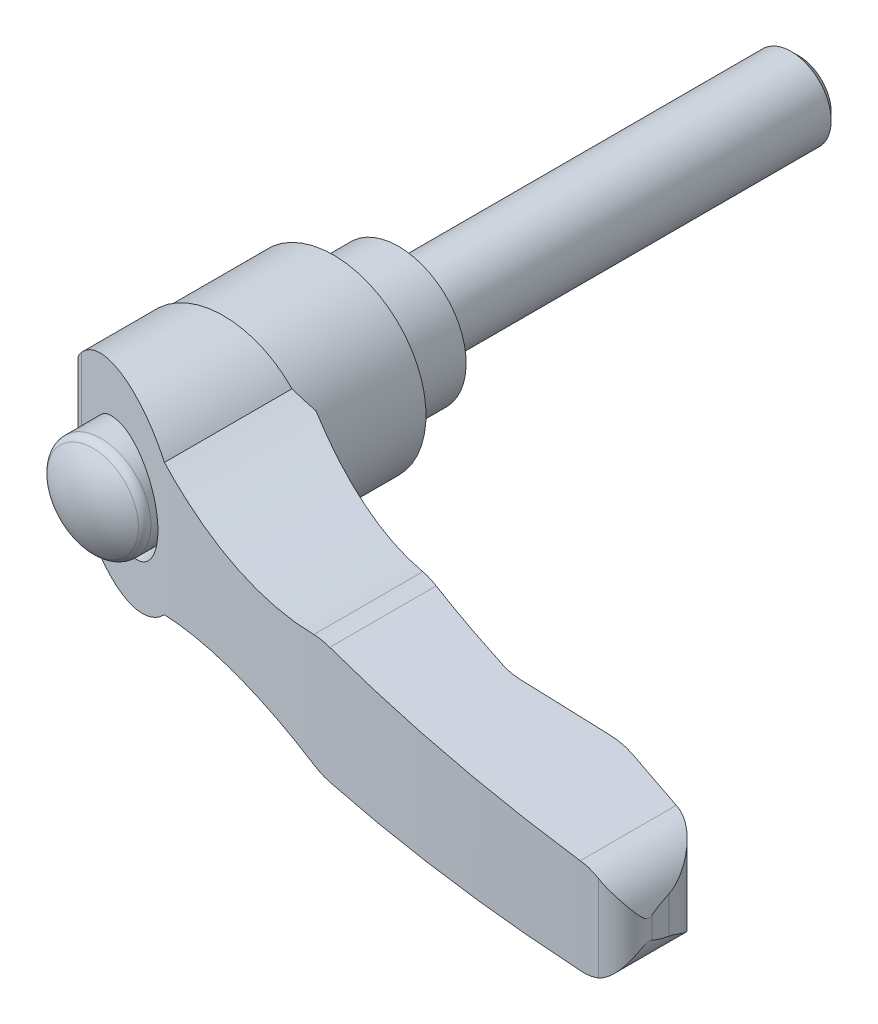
ISO-10303-21;
HEADER;
FILE_DESCRIPTION(('STEP AP214'),'2;1');
FILE_NAME('part.step','',(''),(''),'','','');
FILE_SCHEMA(('AUTOMOTIVE_DESIGN { 1 0 10303 214 1 1 1 1 }'));
ENDSEC;
DATA;
#1=APPLICATION_CONTEXT('core data for automotive mechanical design processes');
#2=APPLICATION_PROTOCOL_DEFINITION('international standard','automotive_design',2000,#1);
#3=PRODUCT_CONTEXT('',#1,'mechanical');
#4=PRODUCT('Part','Part','',(#3));
#5=PRODUCT_RELATED_PRODUCT_CATEGORY('part','',(#4));
#6=PRODUCT_DEFINITION_FORMATION('','',#4);
#7=PRODUCT_DEFINITION_CONTEXT('part definition',#1,'design');
#8=PRODUCT_DEFINITION('design','',#6,#7);
#9=PRODUCT_DEFINITION_SHAPE('','',#8);
#10=(LENGTH_UNIT() NAMED_UNIT(*) SI_UNIT(.MILLI.,.METRE.));
#11=(NAMED_UNIT(*) PLANE_ANGLE_UNIT() SI_UNIT($,.RADIAN.));
#12=(NAMED_UNIT(*) SI_UNIT($,.STERADIAN.) SOLID_ANGLE_UNIT());
#13=UNCERTAINTY_MEASURE_WITH_UNIT(LENGTH_MEASURE(1.E-05),#10,'distance_accuracy_value','');
#14=(GEOMETRIC_REPRESENTATION_CONTEXT(3) GLOBAL_UNCERTAINTY_ASSIGNED_CONTEXT((#13)) GLOBAL_UNIT_ASSIGNED_CONTEXT((#10,
#11,#12)) REPRESENTATION_CONTEXT('',''));
#15=CARTESIAN_POINT('',(0.,0.,0.));
#16=DIRECTION('',(0.,0.,1.));
#17=DIRECTION('',(1.,0.,0.));
#18=AXIS2_PLACEMENT_3D('',#15,#16,#17);
#19=CARTESIAN_POINT('',(0.,0.,-7.1165));
#20=DIRECTION('',(0.,0.,-1.));
#21=DIRECTION('',(0.,1.,0.));
#22=AXIS2_PLACEMENT_3D('',#19,#20,#21);
#23=CYLINDRICAL_SURFACE('',#22,4.);
#24=CARTESIAN_POINT('',(0.,0.,0.));
#25=DIRECTION('',(0.,0.,-1.));
#26=DIRECTION('',(0.,1.,0.));
#27=AXIS2_PLACEMENT_3D('',#24,#25,#26);
#28=CIRCLE('',#27,4.);
#29=CARTESIAN_POINT('',(0.,4.,0.));
#30=VERTEX_POINT('',#29);
#31=EDGE_CURVE('E17',#30,#30,#28,.F.);
#32=ORIENTED_EDGE('',*,*,#31,.F.);
#33=EDGE_LOOP('',(#32));
#34=FACE_BOUND('',#33,.T.);
#35=CARTESIAN_POINT('',(0.,0.,-39.2329999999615));
#36=DIRECTION('',(0.,0.,1.));
#37=DIRECTION('',(1.,0.,0.));
#38=AXIS2_PLACEMENT_3D('',#35,#36,#37);
#39=CIRCLE('',#38,4.);
#40=CARTESIAN_POINT('',(4.,0.,-39.2329999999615));
#41=VERTEX_POINT('',#40);
#42=EDGE_CURVE('E445',#41,#41,#39,.T.);
#43=ORIENTED_EDGE('',*,*,#42,.T.);
#44=EDGE_LOOP('',(#43));
#45=FACE_BOUND('',#44,.T.);
#46=ADVANCED_FACE('F14',(#34,#45),#23,.T.);
#47=CARTESIAN_POINT('',(5.375,0.,0.));
#48=DIRECTION('',(0.,0.,-1.));
#49=DIRECTION('',(0.,1.,0.));
#50=AXIS2_PLACEMENT_3D('',#47,#48,#49);
#51=PLANE('',#50);
#52=ORIENTED_EDGE('',*,*,#31,.T.);
#53=EDGE_LOOP('',(#52));
#54=FACE_BOUND('',#53,.T.);
#55=CARTESIAN_POINT('',(0.,0.,0.));
#56=DIRECTION('',(0.,0.,-1.));
#57=DIRECTION('',(0.,1.,0.));
#58=AXIS2_PLACEMENT_3D('',#55,#56,#57);
#59=CIRCLE('',#58,6.75);
#60=CARTESIAN_POINT('',(0.,6.75,0.));
#61=VERTEX_POINT('',#60);
#62=EDGE_CURVE('E194',#61,#61,#59,.F.);
#63=ORIENTED_EDGE('',*,*,#62,.F.);
#64=EDGE_LOOP('',(#63));
#65=FACE_BOUND('',#64,.T.);
#66=ADVANCED_FACE('F839',(#54,#65),#51,.T.);
#67=CARTESIAN_POINT('',(0.,0.,8.25));
#68=DIRECTION('',(0.,0.,-1.));
#69=DIRECTION('',(0.,1.,0.));
#70=AXIS2_PLACEMENT_3D('',#67,#68,#69);
#71=CYLINDRICAL_SURFACE('',#70,6.75);
#72=ORIENTED_EDGE('',*,*,#62,.T.);
#73=EDGE_LOOP('',(#72));
#74=FACE_BOUND('',#73,.T.);
#75=CARTESIAN_POINT('',(0.,0.,7.15000000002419));
#76=DIRECTION('',(0.,0.,-1.));
#77=DIRECTION('',(1.,0.,0.));
#78=AXIS2_PLACEMENT_3D('',#75,#76,#77);
#79=CIRCLE('',#78,6.74999999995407);
#80=CARTESIAN_POINT('',(6.74999999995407,0.,7.15000000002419));
#81=VERTEX_POINT('',#80);
#82=EDGE_CURVE('E192',#81,#81,#79,.T.);
#83=ORIENTED_EDGE('',*,*,#82,.T.);
#84=EDGE_LOOP('',(#83));
#85=FACE_BOUND('',#84,.T.);
#86=ADVANCED_FACE('F829',(#74,#85),#71,.T.);
#87=CARTESIAN_POINT('',(0.,0.,6.9000000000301));
#88=DIRECTION('',(0.,0.,-1.));
#89=DIRECTION('',(0.,1.,0.));
#90=AXIS2_PLACEMENT_3D('',#87,#88,#89);
#91=CONICAL_SURFACE('',#90,7.000000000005,0.785398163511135);
#92=ORIENTED_EDGE('',*,*,#82,.F.);
#93=EDGE_LOOP('',(#92));
#94=FACE_BOUND('',#93,.T.);
#95=CARTESIAN_POINT('',(0.,0.,6.9));
#96=DIRECTION('',(0.,0.,-1.));
#97=DIRECTION('',(0.,1.,0.));
#98=AXIS2_PLACEMENT_3D('',#95,#96,#97);
#99=CIRCLE('',#98,7.);
#100=CARTESIAN_POINT('',(0.,7.,6.9));
#101=VERTEX_POINT('',#100);
#102=EDGE_CURVE('E184',#101,#101,#99,.T.);
#103=ORIENTED_EDGE('',*,*,#102,.T.);
#104=EDGE_LOOP('',(#103));
#105=FACE_BOUND('',#104,.T.);
#106=ADVANCED_FACE('F819',(#94,#105),#91,.F.);
#107=CARTESIAN_POINT('',(0.,0.,6.2));
#108=DIRECTION('',(0.,0.,-1.));
#109=DIRECTION('',(0.,1.,0.));
#110=AXIS2_PLACEMENT_3D('',#107,#108,#109);
#111=CYLINDRICAL_SURFACE('',#110,7.);
#112=ORIENTED_EDGE('',*,*,#102,.F.);
#113=EDGE_LOOP('',(#112));
#114=FACE_BOUND('',#113,.T.);
#115=CARTESIAN_POINT('',(0.,0.,6.5));
#116=DIRECTION('',(0.,0.,-1.));
#117=DIRECTION('',(0.,1.,0.));
#118=AXIS2_PLACEMENT_3D('',#115,#116,#117);
#119=CIRCLE('',#118,7.);
#120=CARTESIAN_POINT('',(0.,7.,6.5));
#121=VERTEX_POINT('',#120);
#122=EDGE_CURVE('E181',#121,#121,#119,.F.);
#123=ORIENTED_EDGE('',*,*,#122,.F.);
#124=EDGE_LOOP('',(#123));
#125=FACE_BOUND('',#124,.T.);
#126=ADVANCED_FACE('F811',(#114,#125),#111,.F.);
#127=CARTESIAN_POINT('',(-9.01003775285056,-19.,6.5));
#128=DIRECTION('',(0.707106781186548,0.,0.707106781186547));
#129=DIRECTION('',(-0.707106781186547,0.,0.707106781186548));
#130=AXIS2_PLACEMENT_3D('',#127,#128,#129);
#131=PLANE('',#130);
#132=DIRECTION('',(0.,1.,0.));
#133=VECTOR('',#132,1.);
#134=CARTESIAN_POINT('',(-9.01003775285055,0.,6.5));
#135=LINE('',#134,#133);
#136=CARTESIAN_POINT('',(-9.01003775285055,-2.13584185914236,6.5));
#137=VERTEX_POINT('',#136);
#138=CARTESIAN_POINT('',(-9.01003775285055,2.13584185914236,6.5));
#139=VERTEX_POINT('',#138);
#140=EDGE_CURVE('E165',#137,#139,#135,.T.);
#141=ORIENTED_EDGE('',*,*,#140,.F.);
#142=CARTESIAN_POINT('',(-0.00999999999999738,0.,-2.50003775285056));
#143=DIRECTION('',(0.707106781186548,0.,0.707106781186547));
#144=DIRECTION('',(-0.707106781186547,0.,0.707106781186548));
#145=AXIS2_PLACEMENT_3D('',#142,#143,#144);
#146=ELLIPSE('',#145,13.0814754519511,9.25);
#147=EDGE_CURVE('E168',#139,#137,#146,.T.);
#148=ORIENTED_EDGE('',*,*,#147,.F.);
#149=EDGE_LOOP('',(#141,#148));
#150=FACE_BOUND('',#149,.T.);
#151=ADVANCED_FACE('F170',(#150),#131,.F.);
#152=CARTESIAN_POINT('',(-4.635,0.,6.5));
#153=DIRECTION('',(0.,0.,-1.));
#154=DIRECTION('',(0.,1.,0.));
#155=AXIS2_PLACEMENT_3D('',#152,#153,#154);
#156=PLANE('',#155);
#157=ORIENTED_EDGE('',*,*,#140,.T.);
#158=CARTESIAN_POINT('',(-0.00999999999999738,0.,6.5));
#159=DIRECTION('',(0.,0.,1.));
#160=DIRECTION('',(-1.,0.,0.));
#161=AXIS2_PLACEMENT_3D('',#158,#159,#160);
#162=CIRCLE('',#161,9.25);
#163=EDGE_CURVE('E172',#137,#139,#162,.T.);
#164=ORIENTED_EDGE('',*,*,#163,.F.);
#165=EDGE_LOOP('',(#157,#164));
#166=FACE_BOUND('',#165,.T.);
#167=ORIENTED_EDGE('',*,*,#122,.T.);
#168=EDGE_LOOP('',(#167));
#169=FACE_BOUND('',#168,.T.);
#170=ADVANCED_FACE('F179',(#166,#169),#156,.T.);
#171=CARTESIAN_POINT('',(-0.00999999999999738,0.,13.5625));
#172=DIRECTION('',(0.,0.,1.));
#173=DIRECTION('',(-1.,0.,0.));
#174=AXIS2_PLACEMENT_3D('',#171,#172,#173);
#175=CYLINDRICAL_SURFACE('',#174,9.25);
#176=ORIENTED_EDGE('',*,*,#163,.T.);
#177=ORIENTED_EDGE('',*,*,#147,.T.);
#178=EDGE_LOOP('',(#176,#177));
#179=FACE_BOUND('',#178,.T.);
#180=CARTESIAN_POINT('',(-0.00999999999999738,0.,17.5));
#181=DIRECTION('',(0.,0.,1.));
#182=DIRECTION('',(-1.,0.,0.));
#183=AXIS2_PLACEMENT_3D('',#180,#181,#182);
#184=CIRCLE('',#183,9.25);
#185=CARTESIAN_POINT('',(-9.26,0.,17.5));
#186=VERTEX_POINT('',#185);
#187=CARTESIAN_POINT('',(9.23999999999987,0.,17.5000000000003));
#188=VERTEX_POINT('',#187);
#189=EDGE_CURVE('E419',#186,#188,#184,.T.);
#190=ORIENTED_EDGE('',*,*,#189,.F.);
#191=CARTESIAN_POINT('',(-0.00999999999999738,0.,17.5));
#192=DIRECTION('',(0.,0.,1.));
#193=DIRECTION('',(-1.,0.,0.));
#194=AXIS2_PLACEMENT_3D('',#191,#192,#193);
#195=CIRCLE('',#194,9.25);
#196=EDGE_CURVE('E428',#188,#186,#195,.T.);
#197=ORIENTED_EDGE('',*,*,#196,.F.);
#198=EDGE_LOOP('',(#190,#197));
#199=FACE_BOUND('',#198,.T.);
#200=ADVANCED_FACE('F174',(#179,#199),#175,.T.);
#201=CARTESIAN_POINT('',(0.,0.,24.));
#202=DIRECTION('',(1.,0.,0.));
#203=DIRECTION('',(0.,0.,1.));
#204=AXIS2_PLACEMENT_3D('',#201,#202,#203);
#205=SPHERICAL_SURFACE('',#204,8.);
#206=CARTESIAN_POINT('',(0.,0.,30.5652144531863));
#207=DIRECTION('',(0.,0.,1.));
#208=DIRECTION('',(0.,-1.,0.));
#209=AXIS2_PLACEMENT_3D('',#206,#207,#208);
#210=CIRCLE('',#209,4.57142857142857);
#211=CARTESIAN_POINT('',(0.,-4.57142857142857,30.5652144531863));
#212=VERTEX_POINT('',#211);
#213=EDGE_CURVE('E403',#212,#212,#210,.F.);
#214=ORIENTED_EDGE('',*,*,#213,.F.);
#215=EDGE_LOOP('',(#214));
#216=FACE_BOUND('',#215,.T.);
#217=ADVANCED_FACE('F778',(#216),#205,.T.);
#218=CARTESIAN_POINT('',(64.6274051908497,-10.5,37.5817950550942));
#219=DIRECTION('',(0.992331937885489,0.,-0.123601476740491));
#220=DIRECTION('',(0.123601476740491,0.,0.992331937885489));
#221=AXIS2_PLACEMENT_3D('',#218,#219,#220);
#222=PLANE('',#221);
#223=CARTESIAN_POINT('',(60.25,0.,2.43788666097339));
#224=DIRECTION('',(0.992331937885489,0.,-0.123601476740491));
#225=DIRECTION('',(0.123601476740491,0.,0.992331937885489));
#226=AXIS2_PLACEMENT_3D('',#223,#224,#225);
#227=ELLIPSE('',#226,38.4299615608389,4.75);
#228=CARTESIAN_POINT('',(64.8745408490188,1.08449155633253,39.5659186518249));
#229=VERTEX_POINT('',#228);
#230=CARTESIAN_POINT('',(64.6274051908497,1.84413226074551,37.5817950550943));
#231=VERTEX_POINT('',#230);
#232=EDGE_CURVE('E555',#229,#231,#227,.F.);
#233=ORIENTED_EDGE('',*,*,#232,.F.);
#234=DIRECTION('',(0.,-1.,0.));
#235=VECTOR('',#234,1.);
#236=CARTESIAN_POINT('',(64.8745408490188,-10.5,39.5659186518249));
#237=LINE('',#236,#235);
#238=CARTESIAN_POINT('',(64.8745408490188,-1.08449155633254,39.5659186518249));
#239=VERTEX_POINT('',#238);
#240=EDGE_CURVE('E495',#239,#229,#237,.F.);
#241=ORIENTED_EDGE('',*,*,#240,.F.);
#242=CARTESIAN_POINT('',(60.25,0.,2.43788666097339));
#243=DIRECTION('',(0.992331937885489,0.,-0.123601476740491));
#244=DIRECTION('',(0.123601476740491,0.,0.992331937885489));
#245=AXIS2_PLACEMENT_3D('',#242,#243,#244);
#246=ELLIPSE('',#245,38.4299615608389,4.75);
#247=CARTESIAN_POINT('',(64.6274051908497,-1.84413226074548,37.5817950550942));
#248=VERTEX_POINT('',#247);
#249=EDGE_CURVE('E504',#248,#239,#246,.F.);
#250=ORIENTED_EDGE('',*,*,#249,.F.);
#251=DIRECTION('',(0.,-1.,0.));
#252=VECTOR('',#251,1.);
#253=CARTESIAN_POINT('',(64.6274051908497,-10.5,37.5817950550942));
#254=LINE('',#253,#252);
#255=EDGE_CURVE('E177',#231,#248,#254,.T.);
#256=ORIENTED_EDGE('',*,*,#255,.F.);
#257=EDGE_LOOP('',(#233,#241,#250,#256));
#258=FACE_BOUND('',#257,.T.);
#259=ADVANCED_FACE('F543',(#258),#222,.T.);
#260=CARTESIAN_POINT('',(58.6337202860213,-10.5,38.3283479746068));
#261=DIRECTION('',(0.,-1.,0.));
#262=DIRECTION('',(1.,0.,0.));
#263=AXIS2_PLACEMENT_3D('',#260,#261,#262);
#264=CYLINDRICAL_SURFACE('',#263,6.04);
#265=CARTESIAN_POINT('',(64.6274051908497,1.84413226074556,37.5817950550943));
#266=CARTESIAN_POINT('',(64.6175868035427,1.86745330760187,37.5030045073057));
#267=CARTESIAN_POINT('',(64.6063375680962,1.89362327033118,37.4253204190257));
#268=CARTESIAN_POINT('',(64.5811702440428,1.95049016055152,37.2721928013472));
#269=CARTESIAN_POINT('',(64.5672561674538,1.98118026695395,37.196746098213));
#270=CARTESIAN_POINT('',(64.5369883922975,2.04585034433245,37.0482136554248));
#271=CARTESIAN_POINT('',(64.520645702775,2.07981523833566,36.9751189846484));
#272=CARTESIAN_POINT('',(64.4855821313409,2.15032519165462,36.8307396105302));
#273=CARTESIAN_POINT('',(64.4668602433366,2.18687133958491,36.7594556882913));
#274=CARTESIAN_POINT('',(64.4072221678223,2.29938724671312,36.547961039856));
#275=CARTESIAN_POINT('',(64.3628565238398,2.37818379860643,36.410218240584));
#276=CARTESIAN_POINT('',(64.2652007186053,2.53960895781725,36.1400450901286));
#277=CARTESIAN_POINT('',(64.2118976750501,2.6222429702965,36.007622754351));
#278=CARTESIAN_POINT('',(64.077119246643,2.81672317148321,35.7040219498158));
#279=CARTESIAN_POINT('',(63.9921849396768,2.92909268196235,35.5347005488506));
#280=CARTESIAN_POINT('',(63.8063278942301,3.15216626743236,35.2039790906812));
#281=CARTESIAN_POINT('',(63.7054078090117,3.26287061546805,35.0425777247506));
#282=CARTESIAN_POINT('',(63.4870671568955,3.47959027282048,34.7278934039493));
#283=CARTESIAN_POINT('',(63.369645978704,3.58560540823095,34.5746107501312));
#284=CARTESIAN_POINT('',(63.1179209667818,3.7899652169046,34.277236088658));
#285=CARTESIAN_POINT('',(62.9836257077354,3.88831374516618,34.1331394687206));
#286=CARTESIAN_POINT('',(62.6561598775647,4.10136712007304,33.815313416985));
#287=CARTESIAN_POINT('',(62.4571888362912,4.2125890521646,33.6450495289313));
#288=CARTESIAN_POINT('',(62.1378586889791,4.36029911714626,33.4069452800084));
#289=CARTESIAN_POINT('',(62.0281124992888,4.40629516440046,33.330558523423));
#290=CARTESIAN_POINT('',(61.8018114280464,4.49098569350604,33.1841350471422));
#291=CARTESIAN_POINT('',(61.6852609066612,4.52968478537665,33.1140943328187));
#292=CARTESIAN_POINT('',(61.4786111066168,4.58924867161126,32.9993621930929));
#293=CARTESIAN_POINT('',(61.3900115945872,4.61209493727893,32.9529824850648));
#294=CARTESIAN_POINT('',(61.209734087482,4.65295056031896,32.8642982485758));
#295=CARTESIAN_POINT('',(61.1180570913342,4.67096147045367,32.82199241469));
#296=CARTESIAN_POINT('',(60.9313596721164,4.70183469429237,32.7415027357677));
#297=CARTESIAN_POINT('',(60.8363219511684,4.71466416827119,32.7033462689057));
#298=CARTESIAN_POINT('',(60.6438287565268,4.73463763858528,32.631712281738));
#299=CARTESIAN_POINT('',(60.5463713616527,4.74177695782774,32.5982386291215));
#300=CARTESIAN_POINT('',(60.4479724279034,4.74587261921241,32.5672639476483));
#301=B_SPLINE_CURVE_WITH_KNOTS('',3,(#265,#266,#267,#268,#269,#270,#271,#272,#273,#274,#275,
#276,#277,#278,#279,#280,#281,#282,#283,#284,#285,#286,#287,#288,#289,#290,#291,#292,#293,#294,
#295,#296,#297,#298,#299,#300),.UNSPECIFIED.,.F.,.F.,(4,2,2,2,2,2,2,2,2,2,2,2,2,2,2,2,2,4),(0.,
0.248076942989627,0.495783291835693,0.742399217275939,0.989119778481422,1.48293160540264,
1.97746142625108,2.63745339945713,3.29733594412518,3.95724294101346,4.61681594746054,
5.46693586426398,5.89075482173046,6.31430511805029,6.62183365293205,6.92926331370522,
7.23861197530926,7.54821464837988),.UNSPECIFIED.);
#302=CARTESIAN_POINT('',(60.4479724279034,4.74587261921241,32.5672639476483));
#303=VERTEX_POINT('',#302);
#304=EDGE_CURVE('E494',#231,#303,#301,.T.);
#305=ORIENTED_EDGE('',*,*,#304,.F.);
#306=ORIENTED_EDGE('',*,*,#255,.T.);
#307=CARTESIAN_POINT('',(60.4479724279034,-4.74587261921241,32.5672639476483));
#308=CARTESIAN_POINT('',(60.5755504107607,-4.74057354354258,32.6074069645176));
#309=CARTESIAN_POINT('',(60.7015088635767,-4.73014540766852,32.6517620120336));
#310=CARTESIAN_POINT('',(60.9490652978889,-4.69992242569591,32.7481786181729));
#311=CARTESIAN_POINT('',(61.0706698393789,-4.6801423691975,32.8002279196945));
#312=CARTESIAN_POINT('',(61.3074659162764,-4.63235500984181,32.9108206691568));
#313=CARTESIAN_POINT('',(61.4227141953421,-4.60444273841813,32.9692844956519));
#314=CARTESIAN_POINT('',(61.6477173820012,-4.54120548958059,33.0925213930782));
#315=CARTESIAN_POINT('',(61.7574696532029,-4.50587699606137,33.1572974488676));
#316=CARTESIAN_POINT('',(61.9940137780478,-4.42040174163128,33.307032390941));
#317=CARTESIAN_POINT('',(62.1193938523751,-4.36870213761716,33.3933358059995));
#318=CARTESIAN_POINT('',(62.3610721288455,-4.25718277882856,33.5732278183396));
#319=CARTESIAN_POINT('',(62.4773638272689,-4.19735729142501,33.6668215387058));
#320=CARTESIAN_POINT('',(62.7012840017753,-4.07066877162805,33.8608437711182));
#321=CARTESIAN_POINT('',(62.8088611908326,-4.00376876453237,33.9613071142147));
#322=CARTESIAN_POINT('',(63.0146476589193,-3.86453813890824,34.1677809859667));
#323=CARTESIAN_POINT('',(63.1128596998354,-3.79220913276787,34.2737898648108));
#324=CARTESIAN_POINT('',(63.3331746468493,-3.6170051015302,34.5290929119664));
#325=CARTESIAN_POINT('',(63.4514763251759,-3.51235864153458,34.6804594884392));
#326=CARTESIAN_POINT('',(63.6718053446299,-3.29808480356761,34.9913387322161));
#327=CARTESIAN_POINT('',(63.7738256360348,-3.18845529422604,35.1508548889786));
#328=CARTESIAN_POINT('',(63.961662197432,-2.96765680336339,35.4770445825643));
#329=CARTESIAN_POINT('',(64.0475378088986,-2.85649513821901,35.6436890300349));
#330=CARTESIAN_POINT('',(64.2038484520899,-2.63586419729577,35.9851508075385));
#331=CARTESIAN_POINT('',(64.2742871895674,-2.52639452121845,36.1599661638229));
#332=CARTESIAN_POINT('',(64.3705847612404,-2.36382517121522,36.4361542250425));
#333=CARTESIAN_POINT('',(64.4019853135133,-2.30809068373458,36.5340606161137));
#334=CARTESIAN_POINT('',(64.4601539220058,-2.20019362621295,36.7330390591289));
#335=CARTESIAN_POINT('',(64.4869269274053,-2.14802727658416,36.8341075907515));
#336=CARTESIAN_POINT('',(64.5357331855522,-2.0489078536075,37.0402846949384));
#337=CARTESIAN_POINT('',(64.5577546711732,-2.00196785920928,37.1454025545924));
#338=CARTESIAN_POINT('',(64.5966140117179,-1.91618262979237,37.360168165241));
#339=CARTESIAN_POINT('',(64.6134353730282,-1.87736327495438,37.4698291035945));
#340=CARTESIAN_POINT('',(64.6274051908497,-1.84413226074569,37.5817950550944));
#341=B_SPLINE_CURVE_WITH_KNOTS('',3,(#307,#308,#309,#310,#311,#312,#313,#314,#315,#316,#317,
#318,#319,#320,#321,#322,#323,#324,#325,#326,#327,#328,#329,#330,#331,#332,#333,#334,#335,#336,
#337,#338,#339,#340),.UNSPECIFIED.,.F.,.F.,(4,2,2,2,2,2,2,2,2,2,2,2,2,2,2,2,4),(0.,
0.401264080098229,0.801895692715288,1.19802151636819,1.5943355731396,2.07588331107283,
2.55777255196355,3.04231807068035,3.52672024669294,4.18208013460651,4.83772302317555,
5.49090678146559,6.14393356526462,6.4946438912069,6.84497677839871,7.19616755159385,
7.54846105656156),.UNSPECIFIED.);
#342=CARTESIAN_POINT('',(60.4479724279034,-4.74587261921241,32.5672639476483));
#343=VERTEX_POINT('',#342);
#344=EDGE_CURVE('E507',#343,#248,#341,.T.);
#345=ORIENTED_EDGE('',*,*,#344,.F.);
#346=DIRECTION('',(0.,-1.,0.));
#347=VECTOR('',#346,1.);
#348=CARTESIAN_POINT('',(60.4479724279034,-10.5,32.5672639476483));
#349=LINE('',#348,#347);
#350=EDGE_CURVE('E417',#303,#343,#349,.T.);
#351=ORIENTED_EDGE('',*,*,#350,.F.);
#352=EDGE_LOOP('',(#305,#306,#345,#351));
#353=FACE_BOUND('',#352,.T.);
#354=ADVANCED_FACE('F537',(#353),#264,.T.);
#355=CARTESIAN_POINT('',(-9.26,-10.5,17.5));
#356=DIRECTION('',(0.,0.,-1.));
#357=DIRECTION('',(0.,1.,0.));
#358=AXIS2_PLACEMENT_3D('',#355,#356,#357);
#359=PLANE('',#358);
#360=DIRECTION('',(0.,-1.,0.));
#361=VECTOR('',#360,1.);
#362=CARTESIAN_POINT('',(-9.26,-10.5,17.5));
#363=LINE('',#362,#361);
#364=CARTESIAN_POINT('',(-9.26,2.12188595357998,17.5));
#365=VERTEX_POINT('',#364);
#366=EDGE_CURVE('E426',#365,#186,#363,.T.);
#367=ORIENTED_EDGE('',*,*,#366,.F.);
#368=CARTESIAN_POINT('',(0.,0.,17.5));
#369=DIRECTION('',(0.,0.,1.));
#370=DIRECTION('',(0.,-1.,0.));
#371=AXIS2_PLACEMENT_3D('',#368,#369,#370);
#372=CIRCLE('',#371,9.5);
#373=CARTESIAN_POINT('',(6.8437408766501,6.58887022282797,17.5));
#374=VERTEX_POINT('',#373);
#375=EDGE_CURVE('E340',#374,#365,#372,.T.);
#376=ORIENTED_EDGE('',*,*,#375,.F.);
#377=CARTESIAN_POINT('',(19.25,44.09,17.5));
#378=DIRECTION('',(0.,0.,1.));
#379=DIRECTION('',(0.,-1.,0.));
#380=AXIS2_PLACEMENT_3D('',#377,#378,#379);
#381=CIRCLE('',#380,39.5);
#382=CARTESIAN_POINT('',(9.23999999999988,5.8794006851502,17.5000000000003));
#383=VERTEX_POINT('',#382);
#384=EDGE_CURVE('E300',#374,#383,#381,.T.);
#385=ORIENTED_EDGE('',*,*,#384,.T.);
#386=DIRECTION('',(0.,-1.,0.));
#387=VECTOR('',#386,1.);
#388=CARTESIAN_POINT('',(9.23999999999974,-10.5,17.5000000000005));
#389=LINE('',#388,#387);
#390=EDGE_CURVE('E406',#383,#188,#389,.T.);
#391=ORIENTED_EDGE('',*,*,#390,.T.);
#392=ORIENTED_EDGE('',*,*,#196,.T.);
#393=EDGE_LOOP('',(#367,#376,#385,#391,#392));
#394=FACE_BOUND('',#393,.T.);
#395=ADVANCED_FACE('F542',(#394),#359,.T.);
#396=CARTESIAN_POINT('',(-9.26,-10.5,21.2038249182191));
#397=DIRECTION('',(-1.,0.,0.));
#398=DIRECTION('',(0.,-1.,0.));
#399=AXIS2_PLACEMENT_3D('',#396,#397,#398);
#400=PLANE('',#399);
#401=ORIENTED_EDGE('',*,*,#366,.T.);
#402=DIRECTION('',(0.,1.,0.));
#403=VECTOR('',#402,1.);
#404=CARTESIAN_POINT('',(-9.26,-10.5,17.5));
#405=LINE('',#404,#403);
#406=CARTESIAN_POINT('',(-9.26,-2.12188595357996,17.5));
#407=VERTEX_POINT('',#406);
#408=EDGE_CURVE('E420',#407,#186,#405,.T.);
#409=ORIENTED_EDGE('',*,*,#408,.F.);
#410=DIRECTION('',(0.,0.,1.));
#411=VECTOR('',#410,1.);
#412=CARTESIAN_POINT('',(-9.26,-2.12188595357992,42.5));
#413=LINE('',#412,#411);
#414=CARTESIAN_POINT('',(-9.26,-2.12188595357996,21.2038249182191));
#415=VERTEX_POINT('',#414);
#416=EDGE_CURVE('E423',#415,#407,#413,.F.);
#417=ORIENTED_EDGE('',*,*,#416,.F.);
#418=DIRECTION('',(0.,-1.,0.));
#419=VECTOR('',#418,1.);
#420=CARTESIAN_POINT('',(-9.26,-10.5,21.2038249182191));
#421=LINE('',#420,#419);
#422=CARTESIAN_POINT('',(-9.26,2.12188595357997,21.2038249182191));
#423=VERTEX_POINT('',#422);
#424=EDGE_CURVE('E475',#423,#415,#421,.T.);
#425=ORIENTED_EDGE('',*,*,#424,.F.);
#426=DIRECTION('',(0.,0.,1.));
#427=VECTOR('',#426,1.);
#428=CARTESIAN_POINT('',(-9.26,2.12188595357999,42.5));
#429=LINE('',#428,#427);
#430=EDGE_CURVE('E343',#365,#423,#429,.T.);
#431=ORIENTED_EDGE('',*,*,#430,.F.);
#432=EDGE_LOOP('',(#401,#409,#417,#425,#431));
#433=FACE_BOUND('',#432,.T.);
#434=ADVANCED_FACE('F740',(#433),#400,.T.);
#435=CARTESIAN_POINT('',(-9.26,-10.5,17.5));
#436=DIRECTION('',(0.,0.,-1.));
#437=DIRECTION('',(0.,1.,0.));
#438=AXIS2_PLACEMENT_3D('',#435,#436,#437);
#439=PLANE('',#438);
#440=DIRECTION('',(0.,-1.,0.));
#441=VECTOR('',#440,1.);
#442=CARTESIAN_POINT('',(9.23999999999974,-10.5,17.5000000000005));
#443=LINE('',#442,#441);
#444=CARTESIAN_POINT('',(9.23999999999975,-5.87940068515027,17.5000000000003));
#445=VERTEX_POINT('',#444);
#446=EDGE_CURVE('E404',#188,#445,#443,.T.);
#447=ORIENTED_EDGE('',*,*,#446,.T.);
#448=CARTESIAN_POINT('',(19.25,-44.09,17.5));
#449=DIRECTION('',(0.,0.,1.));
#450=DIRECTION('',(0.,-1.,0.));
#451=AXIS2_PLACEMENT_3D('',#448,#449,#450);
#452=CIRCLE('',#451,39.5);
#453=CARTESIAN_POINT('',(6.84374087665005,-6.588870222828,17.5));
#454=VERTEX_POINT('',#453);
#455=EDGE_CURVE('E474',#445,#454,#452,.T.);
#456=ORIENTED_EDGE('',*,*,#455,.T.);
#457=CARTESIAN_POINT('',(0.,0.,17.5));
#458=DIRECTION('',(0.,0.,1.));
#459=DIRECTION('',(0.,-1.,0.));
#460=AXIS2_PLACEMENT_3D('',#457,#458,#459);
#461=CIRCLE('',#460,9.5);
#462=EDGE_CURVE('E478',#407,#454,#461,.T.);
#463=ORIENTED_EDGE('',*,*,#462,.F.);
#464=ORIENTED_EDGE('',*,*,#408,.T.);
#465=ORIENTED_EDGE('',*,*,#189,.T.);
#466=EDGE_LOOP('',(#447,#456,#463,#464,#465));
#467=FACE_BOUND('',#466,.T.);
#468=ADVANCED_FACE('F732',(#467),#439,.T.);
#469=CARTESIAN_POINT('',(53.8294507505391,-10.5,30.4829917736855));
#470=DIRECTION('',(0.300372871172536,0.,-0.953821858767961));
#471=DIRECTION('',(0.953821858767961,0.,0.300372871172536));
#472=AXIS2_PLACEMENT_3D('',#469,#470,#471);
#473=PLANE('',#472);
#474=CARTESIAN_POINT('',(60.25,0.,32.5049194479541));
#475=DIRECTION('',(0.300372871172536,0.,-0.953821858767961));
#476=DIRECTION('',(0.953821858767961,0.,0.300372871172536));
#477=AXIS2_PLACEMENT_3D('',#474,#475,#476);
#478=ELLIPSE('',#477,4.97996555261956,4.75);
#479=CARTESIAN_POINT('',(60.25,4.75,32.5049194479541));
#480=VERTEX_POINT('',#479);
#481=EDGE_CURVE('E496',#303,#480,#478,.F.);
#482=ORIENTED_EDGE('',*,*,#481,.F.);
#483=ORIENTED_EDGE('',*,*,#350,.T.);
#484=CARTESIAN_POINT('',(60.25,0.,32.5049194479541));
#485=DIRECTION('',(0.300372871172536,0.,-0.953821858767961));
#486=DIRECTION('',(0.953821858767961,0.,0.300372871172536));
#487=AXIS2_PLACEMENT_3D('',#484,#485,#486);
#488=ELLIPSE('',#487,4.97996555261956,4.75);
#489=CARTESIAN_POINT('',(60.25,-4.75,32.5049194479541));
#490=VERTEX_POINT('',#489);
#491=EDGE_CURVE('E536',#490,#343,#488,.F.);
#492=ORIENTED_EDGE('',*,*,#491,.F.);
#493=DIRECTION('',(-0.953255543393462,-0.0344545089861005,-0.300194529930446));
#494=VECTOR('',#493,1.);
#495=CARTESIAN_POINT('',(60.25,-4.75,32.5049194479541));
#496=LINE('',#495,#494);
#497=CARTESIAN_POINT('',(53.8294507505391,-4.98206460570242,30.4829917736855));
#498=VERTEX_POINT('',#497);
#499=EDGE_CURVE('E464',#490,#498,#496,.T.);
#500=ORIENTED_EDGE('',*,*,#499,.T.);
#501=DIRECTION('',(0.,-1.,0.));
#502=VECTOR('',#501,1.);
#503=CARTESIAN_POINT('',(53.8294507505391,-10.5,30.4829917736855));
#504=LINE('',#503,#502);
#505=CARTESIAN_POINT('',(53.8294507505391,4.98206460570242,30.4829917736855));
#506=VERTEX_POINT('',#505);
#507=EDGE_CURVE('E414',#506,#498,#504,.T.);
#508=ORIENTED_EDGE('',*,*,#507,.F.);
#509=DIRECTION('',(0.953255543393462,-0.0344545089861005,0.300194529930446));
#510=VECTOR('',#509,1.);
#511=CARTESIAN_POINT('',(53.8294507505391,4.98206460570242,30.4829917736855));
#512=LINE('',#511,#510);
#513=EDGE_CURVE('E299',#506,#480,#512,.T.);
#514=ORIENTED_EDGE('',*,*,#513,.T.);
#515=EDGE_LOOP('',(#482,#483,#492,#500,#508,#514));
#516=FACE_BOUND('',#515,.T.);
#517=ADVANCED_FACE('F573',(#516),#473,.T.);
#518=CARTESIAN_POINT('',(51.0780352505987,-10.5,39.22));
#519=DIRECTION('',(0.,-1.,0.));
#520=DIRECTION('',(1.,0.,0.));
#521=AXIS2_PLACEMENT_3D('',#518,#519,#520);
#522=CYLINDRICAL_SURFACE('',#521,9.15999999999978);
#523=CARTESIAN_POINT('',(51.0780352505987,5.08151188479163,39.22));
#524=DIRECTION('',(-0.0361204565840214,-0.999347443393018,0.));
#525=DIRECTION('',(0.999347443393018,-0.0361204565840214,0.));
#526=AXIS2_PLACEMENT_3D('',#523,#524,#525);
#527=ELLIPSE('',#526,9.16598132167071,9.15999999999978);
#528=CARTESIAN_POINT('',(51.0780352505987,5.08151188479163,30.06));
#529=VERTEX_POINT('',#528);
#530=EDGE_CURVE('E302',#529,#506,#527,.T.);
#531=ORIENTED_EDGE('',*,*,#530,.T.);
#532=ORIENTED_EDGE('',*,*,#507,.T.);
#533=CARTESIAN_POINT('',(51.0780352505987,-5.08151188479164,39.22));
#534=DIRECTION('',(-0.0361204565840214,0.999347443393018,0.));
#535=DIRECTION('',(-0.999347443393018,-0.0361204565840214,0.));
#536=AXIS2_PLACEMENT_3D('',#533,#534,#535);
#537=ELLIPSE('',#536,9.16598132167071,9.15999999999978);
#538=CARTESIAN_POINT('',(51.0780352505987,-5.08151188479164,30.06));
#539=VERTEX_POINT('',#538);
#540=EDGE_CURVE('E463',#498,#539,#537,.T.);
#541=ORIENTED_EDGE('',*,*,#540,.T.);
#542=DIRECTION('',(0.,1.,0.));
#543=VECTOR('',#542,1.);
#544=CARTESIAN_POINT('',(51.0780352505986,-10.5,30.06));
#545=LINE('',#544,#543);
#546=EDGE_CURVE('E411',#529,#539,#545,.F.);
#547=ORIENTED_EDGE('',*,*,#546,.F.);
#548=EDGE_LOOP('',(#531,#532,#541,#547));
#549=FACE_BOUND('',#548,.T.);
#550=ADVANCED_FACE('F716',(#549),#522,.T.);
#551=CARTESIAN_POINT('',(42.239481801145,-10.5,30.06));
#552=DIRECTION('',(0.,0.,-1.));
#553=DIRECTION('',(0.,1.,0.));
#554=AXIS2_PLACEMENT_3D('',#551,#552,#553);
#555=PLANE('',#554);
#556=DIRECTION('',(0.999347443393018,-0.0361204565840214,0.));
#557=VECTOR('',#556,1.);
#558=CARTESIAN_POINT('',(30.3472861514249,5.83080496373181,30.06));
#559=LINE('',#558,#557);
#560=CARTESIAN_POINT('',(42.239481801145,5.4009729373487,30.06));
#561=VERTEX_POINT('',#560);
#562=EDGE_CURVE('E488',#561,#529,#559,.T.);
#563=ORIENTED_EDGE('',*,*,#562,.T.);
#564=ORIENTED_EDGE('',*,*,#546,.T.);
#565=DIRECTION('',(-0.999347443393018,-0.0361204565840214,0.));
#566=VECTOR('',#565,1.);
#567=CARTESIAN_POINT('',(60.25,-4.75,30.06));
#568=LINE('',#567,#566);
#569=CARTESIAN_POINT('',(42.239481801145,-5.4009729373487,30.06));
#570=VERTEX_POINT('',#569);
#571=EDGE_CURVE('E460',#539,#570,#568,.T.);
#572=ORIENTED_EDGE('',*,*,#571,.T.);
#573=DIRECTION('',(0.,-1.,0.));
#574=VECTOR('',#573,1.);
#575=CARTESIAN_POINT('',(42.239481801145,-10.5,30.06));
#576=LINE('',#575,#574);
#577=EDGE_CURVE('E409',#570,#561,#576,.F.);
#578=ORIENTED_EDGE('',*,*,#577,.T.);
#579=EDGE_LOOP('',(#563,#564,#572,#578));
#580=FACE_BOUND('',#579,.T.);
#581=ADVANCED_FACE('F708',(#580),#555,.T.);
#582=CARTESIAN_POINT('',(42.2394818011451,-10.5,23.0799999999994));
#583=DIRECTION('',(0.,-1.,0.));
#584=DIRECTION('',(1.,0.,0.));
#585=AXIS2_PLACEMENT_3D('',#582,#583,#584);
#586=CYLINDRICAL_SURFACE('',#585,6.98000000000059);
#587=DIRECTION('',(0.,-1.,0.));
#588=VECTOR('',#587,1.);
#589=CARTESIAN_POINT('',(40.3024609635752,-10.5,29.785844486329));
#590=LINE('',#589,#588);
#591=CARTESIAN_POINT('',(40.3024609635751,-5.47098470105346,29.7858444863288));
#592=VERTEX_POINT('',#591);
#593=CARTESIAN_POINT('',(40.3024609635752,5.47098470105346,29.7858444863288));
#594=VERTEX_POINT('',#593);
#595=EDGE_CURVE('E401',#592,#594,#590,.F.);
#596=ORIENTED_EDGE('',*,*,#595,.T.);
#597=CARTESIAN_POINT('',(42.2394818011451,5.40097293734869,23.0799999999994));
#598=DIRECTION('',(-0.0361204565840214,-0.999347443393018,0.));
#599=DIRECTION('',(0.999347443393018,-0.0361204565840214,0.));
#600=AXIS2_PLACEMENT_3D('',#597,#598,#599);
#601=ELLIPSE('',#600,6.98455781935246,6.98000000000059);
#602=EDGE_CURVE('E491',#594,#561,#601,.F.);
#603=ORIENTED_EDGE('',*,*,#602,.T.);
#604=ORIENTED_EDGE('',*,*,#577,.F.);
#605=CARTESIAN_POINT('',(42.2394818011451,-5.4009729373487,23.0799999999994));
#606=DIRECTION('',(-0.0361204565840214,0.999347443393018,0.));
#607=DIRECTION('',(-0.999347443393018,-0.0361204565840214,0.));
#608=AXIS2_PLACEMENT_3D('',#605,#606,#607);
#609=ELLIPSE('',#608,6.98455781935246,6.98000000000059);
#610=EDGE_CURVE('E462',#570,#592,#609,.F.);
#611=ORIENTED_EDGE('',*,*,#610,.T.);
#612=EDGE_LOOP('',(#596,#603,#604,#611));
#613=FACE_BOUND('',#612,.T.);
#614=ADVANCED_FACE('F310',(#613),#586,.F.);
#615=CARTESIAN_POINT('',(88.9416647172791,-10.5,-138.600024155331));
#616=DIRECTION('',(0.,-1.,0.));
#617=DIRECTION('',(1.,0.,0.));
#618=AXIS2_PLACEMENT_3D('',#615,#616,#617);
#619=CYLINDRICAL_SURFACE('',#618,175.27);
#620=CARTESIAN_POINT('',(30.3472861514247,5.83080496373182,26.5855433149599));
#621=CARTESIAN_POINT('',(30.1696679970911,5.83722947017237,26.5225405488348));
#622=CARTESIAN_POINT('',(29.9919650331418,5.83772087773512,26.45918181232));
#623=CARTESIAN_POINT('',(29.6377732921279,5.82691956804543,26.3322542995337));
#624=CARTESIAN_POINT('',(29.461282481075,5.81567269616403,26.2686872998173));
#625=CARTESIAN_POINT('',(29.1095062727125,5.78152581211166,26.1413510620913));
#626=CARTESIAN_POINT('',(28.9342208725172,5.75862582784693,26.0775818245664));
#627=CARTESIAN_POINT('',(28.5848474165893,5.70116062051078,25.9498538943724));
#628=CARTESIAN_POINT('',(28.4107667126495,5.6665501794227,25.8858954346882));
#629=CARTESIAN_POINT('',(28.2379732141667,5.62616845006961,25.8220994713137));
#630=B_SPLINE_CURVE_WITH_KNOTS('',3,(#620,#621,#622,#623,#624,#625,#626,#627,#628,#629),
.UNSPECIFIED.,.F.,.F.,(4,2,2,2,4),(0.,0.565613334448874,1.1290258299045,1.69243697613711,
2.2580489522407),.UNSPECIFIED.);
#631=CARTESIAN_POINT('',(30.3472861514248,5.83080496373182,26.5855433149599));
#632=VERTEX_POINT('',#631);
#633=CARTESIAN_POINT('',(28.2379732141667,5.62616845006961,25.8220994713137));
#634=VERTEX_POINT('',#633);
#635=EDGE_CURVE('E290',#632,#634,#630,.T.);
#636=ORIENTED_EDGE('',*,*,#635,.F.);
#637=CARTESIAN_POINT('',(88.9416647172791,3.71296724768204,-138.600024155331));
#638=DIRECTION('',(-0.0361204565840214,-0.999347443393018,0.));
#639=DIRECTION('',(0.999347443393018,-0.0361204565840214,0.));
#640=AXIS2_PLACEMENT_3D('',#637,#638,#639);
#641=ELLIPSE('',#640,175.384448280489,175.27);
#642=EDGE_CURVE('E493',#632,#594,#641,.F.);
#643=ORIENTED_EDGE('',*,*,#642,.T.);
#644=ORIENTED_EDGE('',*,*,#595,.F.);
#645=CARTESIAN_POINT('',(88.9416647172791,-3.71296724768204,-138.600024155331));
#646=DIRECTION('',(-0.0361204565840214,0.999347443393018,0.));
#647=DIRECTION('',(-0.999347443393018,-0.0361204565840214,0.));
#648=AXIS2_PLACEMENT_3D('',#645,#646,#647);
#649=ELLIPSE('',#648,175.384448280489,175.27);
#650=CARTESIAN_POINT('',(30.3472861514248,-5.83080496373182,26.5855433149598));
#651=VERTEX_POINT('',#650);
#652=EDGE_CURVE('E396',#592,#651,#649,.F.);
#653=ORIENTED_EDGE('',*,*,#652,.T.);
#654=CARTESIAN_POINT('',(28.237973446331,-5.6261685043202,25.8220995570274));
#655=CARTESIAN_POINT('',(28.4107669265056,-5.66655022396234,25.8858955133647));
#656=CARTESIAN_POINT('',(28.584847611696,-5.70116065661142,25.9498539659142));
#657=CARTESIAN_POINT('',(28.9342210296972,-5.75862584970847,26.0775818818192));
#658=CARTESIAN_POINT('',(29.1095064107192,-5.78152582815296,26.1413511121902));
#659=CARTESIAN_POINT('',(29.461282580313,-5.81567270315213,26.2686873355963));
#660=CARTESIAN_POINT('',(29.6377733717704,-5.82691957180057,26.3322543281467));
#661=CARTESIAN_POINT('',(29.9919650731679,-5.83772087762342,26.4591818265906));
#662=CARTESIAN_POINT('',(30.169668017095,-5.83722946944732,26.5225405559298));
#663=CARTESIAN_POINT('',(30.3472861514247,-5.83080496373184,26.5855433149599));
#664=B_SPLINE_CURVE_WITH_KNOTS('',3,(#654,#655,#656,#657,#658,#659,#660,#661,#662,#663),
.UNSPECIFIED.,.F.,.F.,(4,2,2,2,4),(0.,0.565611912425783,1.12902299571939,1.69243542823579,
2.25804869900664),.UNSPECIFIED.);
#665=CARTESIAN_POINT('',(28.237973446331,-5.6261685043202,25.8220995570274));
#666=VERTEX_POINT('',#665);
#667=EDGE_CURVE('E327',#666,#651,#664,.T.);
#668=ORIENTED_EDGE('',*,*,#667,.F.);
#669=CARTESIAN_POINT('',(28.237973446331,-5.6261685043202,25.8220995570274));
#670=CARTESIAN_POINT('',(27.6467124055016,-5.48799745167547,25.6038196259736));
#671=CARTESIAN_POINT('',(27.0537779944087,-5.3638308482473,25.3812778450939));
#672=CARTESIAN_POINT('',(25.8659006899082,-5.14331117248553,24.9280288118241));
#673=CARTESIAN_POINT('',(25.2709579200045,-5.04695642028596,24.6973220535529));
#674=CARTESIAN_POINT('',(24.0803912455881,-4.88185687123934,24.2280988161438));
#675=CARTESIAN_POINT('',(23.4847674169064,-4.81310925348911,23.9895831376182));
#676=CARTESIAN_POINT('',(22.2940534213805,-4.70292970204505,23.5051335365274));
#677=CARTESIAN_POINT('',(21.6989632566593,-4.66149787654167,23.2591995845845));
#678=CARTESIAN_POINT('',(19.93823636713,-4.57874286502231,22.520112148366));
#679=CARTESIAN_POINT('',(18.7748149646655,-4.57591682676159,22.0168726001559));
#680=CARTESIAN_POINT('',(16.4631439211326,-4.67145944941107,20.9870607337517));
#681=CARTESIAN_POINT('',(15.3148886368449,-4.76978933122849,20.4604974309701));
#682=CARTESIAN_POINT('',(13.7610005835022,-4.97097993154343,19.7276539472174));
#683=CARTESIAN_POINT('',(13.3455946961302,-5.03153416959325,19.5297267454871));
#684=CARTESIAN_POINT('',(12.518128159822,-5.16561835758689,19.1314774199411));
#685=CARTESIAN_POINT('',(12.1060667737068,-5.23914536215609,18.9311558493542));
#686=CARTESIAN_POINT('',(11.282699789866,-5.39957122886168,18.526898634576));
#687=CARTESIAN_POINT('',(10.8714191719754,-5.48655913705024,18.3229475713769));
#688=CARTESIAN_POINT('',(10.0527171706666,-5.67338492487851,17.9129677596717));
#689=CARTESIAN_POINT('',(9.64529662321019,-5.77322552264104,17.7069385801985));
#690=CARTESIAN_POINT('',(9.23999999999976,-5.87940068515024,17.5000000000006));
#691=B_SPLINE_CURVE_WITH_KNOTS('',3,(#669,#670,#671,#672,#673,#674,#675,#676,#677,#678,#679,
#680,#681,#682,#683,#684,#685,#686,#687,#688,#689,#690),.UNSPECIFIED.,.F.,.F.,(4,2,2,2,2,2,2,2,
2,2,4),(0.,1.93549726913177,3.87087760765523,5.80606013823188,7.74125033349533,11.5393004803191,
15.3358951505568,16.7281050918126,18.1199993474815,19.5215293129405,20.9233561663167),.UNSPECIFIED.);
#692=EDGE_CURVE('E318',#666,#445,#691,.T.);
#693=ORIENTED_EDGE('',*,*,#692,.T.);
#694=ORIENTED_EDGE('',*,*,#446,.F.);
#695=ORIENTED_EDGE('',*,*,#390,.F.);
#696=CARTESIAN_POINT('',(9.23999999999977,5.87940068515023,17.5000000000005));
#697=CARTESIAN_POINT('',(9.79948003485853,5.73283344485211,17.7856672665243));
#698=CARTESIAN_POINT('',(10.363016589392,5.59833643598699,18.0695987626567));
#699=CARTESIAN_POINT('',(11.4974282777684,5.35391463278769,18.6334448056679));
#700=CARTESIAN_POINT('',(12.068303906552,5.24399150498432,18.9133590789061));
#701=CARTESIAN_POINT('',(13.2171050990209,5.04907387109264,19.4688580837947));
#702=CARTESIAN_POINT('',(13.795037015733,4.9641038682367,19.7444383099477));
#703=CARTESIAN_POINT('',(14.9564491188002,4.81968144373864,20.2904183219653));
#704=CARTESIAN_POINT('',(15.5399291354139,4.7602282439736,20.56081826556));
#705=CARTESIAN_POINT('',(17.2745449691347,4.62260622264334,21.3530632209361));
#706=CARTESIAN_POINT('',(18.4324989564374,4.58133087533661,21.8669029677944));
#707=CARTESIAN_POINT('',(20.7578250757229,4.60168529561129,22.8686662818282));
#708=CARTESIAN_POINT('',(21.9251896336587,4.66323920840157,23.3566086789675));
#709=CARTESIAN_POINT('',(23.5210667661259,4.81923174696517,24.0035807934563));
#710=CARTESIAN_POINT('',(23.9492706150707,4.86815261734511,24.1752006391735));
#711=CARTESIAN_POINT('',(24.8053597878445,4.98022825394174,24.5144113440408));
#712=CARTESIAN_POINT('',(25.2332451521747,5.04338070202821,24.6820028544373));
#713=CARTESIAN_POINT('',(26.0913485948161,5.18451987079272,25.01422907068));
#714=CARTESIAN_POINT('',(26.5215612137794,5.26261039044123,25.1788336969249));
#715=CARTESIAN_POINT('',(27.3808010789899,5.43340909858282,25.5037362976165));
#716=CARTESIAN_POINT('',(27.8098280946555,5.52611995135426,25.6640334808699));
#717=CARTESIAN_POINT('',(28.2379732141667,5.6261684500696,25.8220994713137));
#718=B_SPLINE_CURVE_WITH_KNOTS('',3,(#696,#697,#698,#699,#700,#701,#702,#703,#704,#705,#706,
#707,#708,#709,#710,#711,#712,#713,#714,#715,#716,#717),.UNSPECIFIED.,.F.,.F.,(4,2,2,2,2,2,2,2,
2,2,4),(0.,1.93506781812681,3.87026682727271,5.80735983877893,7.74439377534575,11.5423680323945,
15.3375418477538,16.7290777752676,18.1203872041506,19.5217406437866,20.9233497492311),.UNSPECIFIED.);
#719=EDGE_CURVE('E333',#383,#634,#718,.T.);
#720=ORIENTED_EDGE('',*,*,#719,.T.);
#721=EDGE_LOOP('',(#636,#643,#644,#653,#668,#693,#694,#695,#720));
#722=FACE_BOUND('',#721,.T.);
#723=ADVANCED_FACE('F304',(#722),#619,.F.);
#724=CARTESIAN_POINT('',(0.,0.,29.744562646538));
#725=DIRECTION('',(0.,0.,1.));
#726=DIRECTION('',(0.,-1.,0.));
#727=AXIS2_PLACEMENT_3D('',#724,#725,#726);
#728=TOROIDAL_SURFACE('',#727,4.,1.);
#729=CARTESIAN_POINT('',(0.,0.,29.744562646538));
#730=DIRECTION('',(0.,0.,-1.));
#731=DIRECTION('',(0.,1.,0.));
#732=AXIS2_PLACEMENT_3D('',#729,#730,#731);
#733=CIRCLE('',#732,5.);
#734=CARTESIAN_POINT('',(0.,5.,29.744562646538));
#735=VERTEX_POINT('',#734);
#736=EDGE_CURVE('E390',#735,#735,#733,.T.);
#737=ORIENTED_EDGE('',*,*,#736,.F.);
#738=EDGE_LOOP('',(#737));
#739=FACE_BOUND('',#738,.T.);
#740=ORIENTED_EDGE('',*,*,#213,.T.);
#741=EDGE_LOOP('',(#740));
#742=FACE_BOUND('',#741,.T.);
#743=ADVANCED_FACE('F309',(#739,#742),#728,.T.);
#744=CARTESIAN_POINT('',(60.25,0.,42.5));
#745=DIRECTION('',(0.,0.,1.));
#746=DIRECTION('',(0.,-1.,0.));
#747=AXIS2_PLACEMENT_3D('',#744,#745,#746);
#748=CYLINDRICAL_SURFACE('',#747,4.75);
#749=ORIENTED_EDGE('',*,*,#249,.T.);
#750=CARTESIAN_POINT('',(62.2749077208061,-4.29677189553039,42.276905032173));
#751=CARTESIAN_POINT('',(62.3484429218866,-4.26213869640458,42.2829554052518));
#752=CARTESIAN_POINT('',(62.4212610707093,-4.22549552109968,42.2855470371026));
#753=CARTESIAN_POINT('',(62.564774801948,-4.14860038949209,42.2843574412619));
#754=CARTESIAN_POINT('',(62.6354735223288,-4.10835415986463,42.2805861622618));
#755=CARTESIAN_POINT('',(62.7735534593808,-4.02500028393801,42.2673020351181));
#756=CARTESIAN_POINT('',(62.8409620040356,-3.98192770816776,42.2578508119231));
#757=CARTESIAN_POINT('',(62.9729170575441,-3.8928858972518,42.2338060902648));
#758=CARTESIAN_POINT('',(63.0374621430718,-3.84691524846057,42.2192100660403));
#759=CARTESIAN_POINT('',(63.1798156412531,-3.7401232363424,42.1810015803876));
#760=CARTESIAN_POINT('',(63.2566999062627,-3.6785524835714,42.1560308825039));
#761=CARTESIAN_POINT('',(63.4051883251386,-3.55201688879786,42.099741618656));
#762=CARTESIAN_POINT('',(63.4767890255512,-3.48704987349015,42.0684189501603));
#763=CARTESIAN_POINT('',(63.684137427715,-3.28726383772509,41.9659030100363));
#764=CARTESIAN_POINT('',(63.811716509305,-3.14810402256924,41.8863686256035));
#765=CARTESIAN_POINT('',(64.0078346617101,-2.90809595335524,41.738770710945));
#766=CARTESIAN_POINT('',(64.0822428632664,-2.80914674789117,41.6751098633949));
#767=CARTESIAN_POINT('',(64.2213033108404,-2.60884800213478,41.5411877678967));
#768=CARTESIAN_POINT('',(64.2859552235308,-2.50749837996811,41.4709262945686));
#769=CARTESIAN_POINT('',(64.4056344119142,-2.30372384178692,41.3246959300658));
#770=CARTESIAN_POINT('',(64.4606832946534,-2.2013019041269,41.2487404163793));
#771=CARTESIAN_POINT('',(64.5615971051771,-1.99640423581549,41.091141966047));
#772=CARTESIAN_POINT('',(64.6074681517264,-1.89392858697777,41.0095028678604));
#773=CARTESIAN_POINT('',(64.6724899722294,-1.73436568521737,40.8759658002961));
#774=CARTESIAN_POINT('',(64.6946729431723,-1.6766282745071,40.8262975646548));
#775=CARTESIAN_POINT('',(64.7361015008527,-1.56239438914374,40.7242511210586));
#776=CARTESIAN_POINT('',(64.7553449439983,-1.50589884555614,40.6718709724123));
#777=CARTESIAN_POINT('',(64.7911041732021,-1.39440450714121,40.5626124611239));
#778=CARTESIAN_POINT('',(64.807565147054,-1.33945042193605,40.5056705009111));
#779=CARTESIAN_POINT('',(64.8370703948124,-1.23458164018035,40.3864037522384));
#780=CARTESIAN_POINT('',(64.8501220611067,-1.18465618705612,40.3240910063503));
#781=CARTESIAN_POINT('',(64.8661549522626,-1.11985818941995,40.2264927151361));
#782=CARTESIAN_POINT('',(64.8707942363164,-1.10049352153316,40.1945209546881));
#783=CARTESIAN_POINT('',(64.8789586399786,-1.06562552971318,40.1283652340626));
#784=CARTESIAN_POINT('',(64.8824848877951,-1.05011829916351,40.0941835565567));
#785=CARTESIAN_POINT('',(64.8876748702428,-1.02693288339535,40.0295882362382));
#786=CARTESIAN_POINT('',(64.889552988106,-1.01837321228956,39.9995179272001));
#787=CARTESIAN_POINT('',(64.8921785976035,-1.00633880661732,39.9383655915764));
#788=CARTESIAN_POINT('',(64.8929291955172,-1.00285010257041,39.9072865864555));
#789=CARTESIAN_POINT('',(64.89321534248,-1.00152501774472,39.8449093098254));
#790=CARTESIAN_POINT('',(64.8927474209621,-1.00370478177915,39.8136106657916));
#791=CARTESIAN_POINT('',(64.8906454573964,-1.01337643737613,39.7517827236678));
#792=CARTESIAN_POINT('',(64.8890063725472,-1.0208912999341,39.7212573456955));
#793=CARTESIAN_POINT('',(64.8852969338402,-1.03758048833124,39.6696465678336));
#794=CARTESIAN_POINT('',(64.8834575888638,-1.04578030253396,39.6482116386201));
#795=CARTESIAN_POINT('',(64.8793233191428,-1.06393290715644,39.6063556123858));
#796=CARTESIAN_POINT('',(64.8770324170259,-1.0738701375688,39.5859274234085));
#797=CARTESIAN_POINT('',(64.8745408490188,-1.0844915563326,39.5659186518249));
#798=B_SPLINE_CURVE_WITH_KNOTS('',3,(#750,#751,#752,#753,#754,#755,#756,#757,#758,#759,#760,
#761,#762,#763,#764,#765,#766,#767,#768,#769,#770,#771,#772,#773,#774,#775,#776,#777,#778,#779,
#780,#781,#782,#783,#784,#785,#786,#787,#788,#789,#790,#791,#792,#793,#794,#795,#796,#797),
.UNSPECIFIED.,.F.,.F.,(4,2,2,2,2,2,2,2,2,2,2,2,2,2,2,2,2,2,2,2,2,2,2,4),(0.,0.244350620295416,
0.488319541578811,0.729688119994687,0.97117536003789,1.27556052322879,1.58014290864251,
2.19203994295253,2.60923519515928,3.02644469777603,3.44270300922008,3.85868287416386,
4.09658232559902,4.33465444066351,4.57697559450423,4.81876687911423,4.93157965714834,
5.04427771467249,5.13787391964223,5.23121179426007,5.32481580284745,5.41882529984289,
5.48780546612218,5.55619684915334),.UNSPECIFIED.);
#799=CARTESIAN_POINT('',(62.2749077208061,-4.2967718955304,42.2769050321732));
#800=VERTEX_POINT('',#799);
#801=EDGE_CURVE('E497',#800,#239,#798,.T.);
#802=ORIENTED_EDGE('',*,*,#801,.F.);
#803=CARTESIAN_POINT('',(60.25,-4.75,42.1009088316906));
#804=CARTESIAN_POINT('',(60.3850127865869,-4.75001526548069,42.1132857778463));
#805=CARTESIAN_POINT('',(60.5200387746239,-4.74424440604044,42.1255330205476));
#806=CARTESIAN_POINT('',(60.7892105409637,-4.72122523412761,42.149694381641));
#807=CARTESIAN_POINT('',(60.9233558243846,-4.70397094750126,42.1616083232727));
#808=CARTESIAN_POINT('',(61.1873029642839,-4.65849581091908,42.1848041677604));
#809=CARTESIAN_POINT('',(61.3171394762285,-4.63047940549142,42.1960936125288));
#810=CARTESIAN_POINT('',(61.5739811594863,-4.56367863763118,42.2181964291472));
#811=CARTESIAN_POINT('',(61.7009880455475,-4.52490099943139,42.2290100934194));
#812=CARTESIAN_POINT('',(61.9022195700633,-4.45411922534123,42.2459686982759));
#813=CARTESIAN_POINT('',(61.977610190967,-4.42542278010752,42.2522814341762));
#814=CARTESIAN_POINT('',(62.1272657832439,-4.36405214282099,42.2647350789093));
#815=CARTESIAN_POINT('',(62.201522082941,-4.33135656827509,42.2708748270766));
#816=CARTESIAN_POINT('',(62.2749077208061,-4.29677189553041,42.2769050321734));
#817=B_SPLINE_CURVE_WITH_KNOTS('',3,(#803,#804,#805,#806,#807,#808,#809,#810,#811,#812,#813,
#814,#815,#816),.UNSPECIFIED.,.F.,.F.,(4,2,2,2,2,2,4),(0.,0.406617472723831,0.813446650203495,
1.2129017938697,1.6121078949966,1.8547546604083,2.09876071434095),.UNSPECIFIED.);
#818=CARTESIAN_POINT('',(60.25,-4.75,42.1009088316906));
#819=VERTEX_POINT('',#818);
#820=EDGE_CURVE('E394',#819,#800,#817,.T.);
#821=ORIENTED_EDGE('',*,*,#820,.F.);
#822=DIRECTION('',(0.,0.,1.));
#823=VECTOR('',#822,1.);
#824=CARTESIAN_POINT('',(60.25,-4.75,42.5));
#825=LINE('',#824,#823);
#826=EDGE_CURVE('E466',#819,#490,#825,.F.);
#827=ORIENTED_EDGE('',*,*,#826,.T.);
#828=ORIENTED_EDGE('',*,*,#491,.T.);
#829=ORIENTED_EDGE('',*,*,#344,.T.);
#830=EDGE_LOOP('',(#749,#802,#821,#827,#828,#829));
#831=FACE_BOUND('',#830,.T.);
#832=ADVANCED_FACE('F518',(#831),#748,.T.);
#833=CARTESIAN_POINT('',(62.4730975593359,-10.5,39.8650342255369));
#834=DIRECTION('',(0.,-1.,0.));
#835=DIRECTION('',(1.,0.,0.));
#836=AXIS2_PLACEMENT_3D('',#833,#834,#835);
#837=CYLINDRICAL_SURFACE('',#836,2.42);
#838=CARTESIAN_POINT('',(62.2749077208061,4.29677189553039,42.276905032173));
#839=CARTESIAN_POINT('',(62.3484429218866,4.26213869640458,42.2829554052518));
#840=CARTESIAN_POINT('',(62.4212610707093,4.22549552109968,42.2855470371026));
#841=CARTESIAN_POINT('',(62.564774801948,4.14860038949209,42.2843574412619));
#842=CARTESIAN_POINT('',(62.6354735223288,4.10835415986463,42.2805861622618));
#843=CARTESIAN_POINT('',(62.7735534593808,4.02500028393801,42.2673020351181));
#844=CARTESIAN_POINT('',(62.8409620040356,3.98192770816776,42.2578508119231));
#845=CARTESIAN_POINT('',(62.9729170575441,3.8928858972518,42.2338060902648));
#846=CARTESIAN_POINT('',(63.0374621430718,3.84691524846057,42.2192100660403));
#847=CARTESIAN_POINT('',(63.1798156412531,3.7401232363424,42.1810015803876));
#848=CARTESIAN_POINT('',(63.2566999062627,3.6785524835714,42.1560308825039));
#849=CARTESIAN_POINT('',(63.4051883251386,3.55201688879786,42.099741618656));
#850=CARTESIAN_POINT('',(63.4767890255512,3.48704987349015,42.0684189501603));
#851=CARTESIAN_POINT('',(63.684137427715,3.28726383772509,41.9659030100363));
#852=CARTESIAN_POINT('',(63.811716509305,3.14810402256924,41.8863686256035));
#853=CARTESIAN_POINT('',(64.0078346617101,2.90809595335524,41.738770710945));
#854=CARTESIAN_POINT('',(64.0822428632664,2.80914674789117,41.6751098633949));
#855=CARTESIAN_POINT('',(64.2213033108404,2.60884800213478,41.5411877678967));
#856=CARTESIAN_POINT('',(64.2859552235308,2.50749837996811,41.4709262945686));
#857=CARTESIAN_POINT('',(64.4056344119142,2.30372384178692,41.3246959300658));
#858=CARTESIAN_POINT('',(64.4606832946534,2.2013019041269,41.2487404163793));
#859=CARTESIAN_POINT('',(64.5615971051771,1.99640423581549,41.091141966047));
#860=CARTESIAN_POINT('',(64.6074681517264,1.89392858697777,41.0095028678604));
#861=CARTESIAN_POINT('',(64.6724899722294,1.73436568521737,40.8759658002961));
#862=CARTESIAN_POINT('',(64.6946729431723,1.6766282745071,40.8262975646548));
#863=CARTESIAN_POINT('',(64.7361015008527,1.56239438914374,40.7242511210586));
#864=CARTESIAN_POINT('',(64.7553449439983,1.50589884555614,40.6718709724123));
#865=CARTESIAN_POINT('',(64.7911041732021,1.39440450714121,40.5626124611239));
#866=CARTESIAN_POINT('',(64.807565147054,1.33945042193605,40.5056705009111));
#867=CARTESIAN_POINT('',(64.8370703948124,1.23458164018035,40.3864037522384));
#868=CARTESIAN_POINT('',(64.8501220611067,1.18465618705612,40.3240910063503));
#869=CARTESIAN_POINT('',(64.8661549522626,1.11985818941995,40.2264927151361));
#870=CARTESIAN_POINT('',(64.8707942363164,1.10049352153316,40.1945209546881));
#871=CARTESIAN_POINT('',(64.8789586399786,1.06562552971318,40.1283652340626));
#872=CARTESIAN_POINT('',(64.8824848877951,1.05011829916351,40.0941835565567));
#873=CARTESIAN_POINT('',(64.8876748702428,1.02693288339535,40.0295882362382));
#874=CARTESIAN_POINT('',(64.889552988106,1.01837321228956,39.9995179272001));
#875=CARTESIAN_POINT('',(64.8921785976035,1.00633880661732,39.9383655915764));
#876=CARTESIAN_POINT('',(64.8929291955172,1.00285010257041,39.9072865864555));
#877=CARTESIAN_POINT('',(64.89321534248,1.00152501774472,39.8449093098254));
#878=CARTESIAN_POINT('',(64.8927474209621,1.00370478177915,39.8136106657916));
#879=CARTESIAN_POINT('',(64.8906454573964,1.01337643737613,39.7517827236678));
#880=CARTESIAN_POINT('',(64.8890063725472,1.0208912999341,39.7212573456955));
#881=CARTESIAN_POINT('',(64.8852969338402,1.03758048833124,39.6696465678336));
#882=CARTESIAN_POINT('',(64.8834575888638,1.04578030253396,39.6482116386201));
#883=CARTESIAN_POINT('',(64.8793233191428,1.06393290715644,39.6063556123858));
#884=CARTESIAN_POINT('',(64.8770324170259,1.0738701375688,39.5859274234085));
#885=CARTESIAN_POINT('',(64.8745408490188,1.0844915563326,39.5659186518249));
#886=B_SPLINE_CURVE_WITH_KNOTS('',3,(#838,#839,#840,#841,#842,#843,#844,#845,#846,#847,#848,
#849,#850,#851,#852,#853,#854,#855,#856,#857,#858,#859,#860,#861,#862,#863,#864,#865,#866,#867,
#868,#869,#870,#871,#872,#873,#874,#875,#876,#877,#878,#879,#880,#881,#882,#883,#884,#885),
.UNSPECIFIED.,.F.,.F.,(4,2,2,2,2,2,2,2,2,2,2,2,2,2,2,2,2,2,2,2,2,2,2,4),(0.,0.244350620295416,
0.488319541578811,0.729688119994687,0.97117536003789,1.27556052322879,1.58014290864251,
2.19203994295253,2.60923519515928,3.02644469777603,3.44270300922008,3.85868287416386,
4.09658232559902,4.33465444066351,4.57697559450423,4.81876687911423,4.93157965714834,
5.04427771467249,5.13787391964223,5.23121179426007,5.32481580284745,5.41882529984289,
5.48780546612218,5.55619684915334),.UNSPECIFIED.);
#887=CARTESIAN_POINT('',(62.2749077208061,4.2967718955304,42.2769050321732));
#888=VERTEX_POINT('',#887);
#889=EDGE_CURVE('E502',#888,#229,#886,.T.);
#890=ORIENTED_EDGE('',*,*,#889,.F.);
#891=DIRECTION('',(0.,-1.,0.));
#892=VECTOR('',#891,1.);
#893=CARTESIAN_POINT('',(62.2749077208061,-10.5,42.2769050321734));
#894=LINE('',#893,#892);
#895=EDGE_CURVE('E455',#800,#888,#894,.F.);
#896=ORIENTED_EDGE('',*,*,#895,.F.);
#897=ORIENTED_EDGE('',*,*,#801,.T.);
#898=ORIENTED_EDGE('',*,*,#240,.T.);
#899=EDGE_LOOP('',(#890,#896,#897,#898));
#900=FACE_BOUND('',#899,.T.);
#901=ADVANCED_FACE('F516',(#900),#837,.T.);
#902=CARTESIAN_POINT('',(60.25,0.,42.5));
#903=DIRECTION('',(0.,0.,1.));
#904=DIRECTION('',(0.,-1.,0.));
#905=AXIS2_PLACEMENT_3D('',#902,#903,#904);
#906=CYLINDRICAL_SURFACE('',#905,4.75);
#907=ORIENTED_EDGE('',*,*,#232,.T.);
#908=ORIENTED_EDGE('',*,*,#304,.T.);
#909=ORIENTED_EDGE('',*,*,#481,.T.);
#910=DIRECTION('',(0.,0.,1.));
#911=VECTOR('',#910,1.);
#912=CARTESIAN_POINT('',(60.25,4.75,42.5));
#913=LINE('',#912,#911);
#914=CARTESIAN_POINT('',(60.25,4.75,42.1009088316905));
#915=VERTEX_POINT('',#914);
#916=EDGE_CURVE('E492',#480,#915,#913,.T.);
#917=ORIENTED_EDGE('',*,*,#916,.T.);
#918=CARTESIAN_POINT('',(62.2749077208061,4.29677189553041,42.2769050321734));
#919=CARTESIAN_POINT('',(62.1526074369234,4.35442457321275,42.2668563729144));
#920=CARTESIAN_POINT('',(62.027854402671,4.40681781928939,42.2564990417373));
#921=CARTESIAN_POINT('',(61.7743193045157,4.50079963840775,42.2352210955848));
#922=CARTESIAN_POINT('',(61.6455353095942,4.54238294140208,42.2243002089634));
#923=CARTESIAN_POINT('',(61.3872932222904,4.61375080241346,42.2021612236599));
#924=CARTESIAN_POINT('',(61.2578894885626,4.6437352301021,42.1909520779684));
#925=CARTESIAN_POINT('',(60.9971282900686,4.69274765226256,42.1681230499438));
#926=CARTESIAN_POINT('',(60.8657720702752,4.71178234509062,42.1565034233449));
#927=CARTESIAN_POINT('',(60.6537297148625,4.73349762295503,42.1375484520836));
#928=CARTESIAN_POINT('',(60.5733751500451,4.7396643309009,42.1303200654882));
#929=CARTESIAN_POINT('',(60.412016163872,4.74792732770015,42.1157134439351));
#930=CARTESIAN_POINT('',(60.3310106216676,4.75000065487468,42.1083345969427));
#931=CARTESIAN_POINT('',(60.25,4.75,42.1009088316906));
#932=B_SPLINE_CURVE_WITH_KNOTS('',3,(#918,#919,#920,#921,#922,#923,#924,#925,#926,#927,#928,
#929,#930,#931),.UNSPECIFIED.,.F.,.F.,(4,2,2,2,2,2,4),(0.,0.406619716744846,0.813437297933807,
1.21289403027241,1.61210613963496,1.8547544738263,2.09876011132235),.UNSPECIFIED.);
#933=EDGE_CURVE('E221',#888,#915,#932,.T.);
#934=ORIENTED_EDGE('',*,*,#933,.F.);
#935=ORIENTED_EDGE('',*,*,#889,.T.);
#936=EDGE_LOOP('',(#907,#908,#909,#917,#934,#935));
#937=FACE_BOUND('',#936,.T.);
#938=ADVANCED_FACE('F556',(#937),#906,.T.);
#939=CARTESIAN_POINT('',(30.3472861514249,5.83080496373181,42.5));
#940=DIRECTION('',(-0.0361204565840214,-0.999347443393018,0.));
#941=DIRECTION('',(0.999347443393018,-0.0361204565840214,0.));
#942=AXIS2_PLACEMENT_3D('',#939,#940,#941);
#943=PLANE('',#942);
#944=ORIENTED_EDGE('',*,*,#530,.F.);
#945=ORIENTED_EDGE('',*,*,#562,.F.);
#946=ORIENTED_EDGE('',*,*,#602,.F.);
#947=ORIENTED_EDGE('',*,*,#642,.F.);
#948=DIRECTION('',(0.,0.,1.));
#949=VECTOR('',#948,1.);
#950=CARTESIAN_POINT('',(30.3472861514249,5.83080496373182,42.5));
#951=LINE('',#950,#949);
#952=CARTESIAN_POINT('',(30.3472861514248,5.83080496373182,37.2241685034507));
#953=VERTEX_POINT('',#952);
#954=EDGE_CURVE('E298',#953,#632,#951,.F.);
#955=ORIENTED_EDGE('',*,*,#954,.F.);
#956=CARTESIAN_POINT('',(79.948199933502,4.03802742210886,-172.7981859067));
#957=DIRECTION('',(-0.0361204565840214,-0.999347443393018,0.));
#958=DIRECTION('',(0.999347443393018,-0.0361204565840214,0.));
#959=AXIS2_PLACEMENT_3D('',#956,#957,#958);
#960=ELLIPSE('',#959,215.940913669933,215.8);
#961=EDGE_CURVE('E279',#915,#953,#960,.T.);
#962=ORIENTED_EDGE('',*,*,#961,.F.);
#963=ORIENTED_EDGE('',*,*,#916,.F.);
#964=ORIENTED_EDGE('',*,*,#513,.F.);
#965=EDGE_LOOP('',(#944,#945,#946,#947,#955,#962,#963,#964));
#966=FACE_BOUND('',#965,.T.);
#967=ADVANCED_FACE('F285',(#966),#943,.F.);
#968=CARTESIAN_POINT('',(30.0583224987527,-2.16397458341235,42.5));
#969=DIRECTION('',(0.,0.,1.));
#970=DIRECTION('',(0.,-1.,0.));
#971=AXIS2_PLACEMENT_3D('',#968,#969,#970);
#972=CYLINDRICAL_SURFACE('',#971,8.);
#973=CARTESIAN_POINT('',(30.3472861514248,5.83080496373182,37.2241685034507));
#974=CARTESIAN_POINT('',(30.1697645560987,5.83722808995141,37.1822446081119));
#975=CARTESIAN_POINT('',(29.9920959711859,5.83772255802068,37.1400457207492));
#976=CARTESIAN_POINT('',(29.6379436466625,5.82692706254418,37.0554559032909));
#977=CARTESIAN_POINT('',(29.4614580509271,5.81568603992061,37.0130664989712));
#978=CARTESIAN_POINT('',(29.1096637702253,5.78154479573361,36.928102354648));
#979=CARTESIAN_POINT('',(28.9343550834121,5.75864459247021,36.8855276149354));
#980=CARTESIAN_POINT('',(28.5849091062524,5.70117409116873,36.8002038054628));
#981=CARTESIAN_POINT('',(28.4107797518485,5.66655551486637,36.7574547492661));
#982=CARTESIAN_POINT('',(28.2379732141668,5.62616845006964,36.7148028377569));
#983=B_SPLINE_CURVE_WITH_KNOTS('',3,(#973,#974,#975,#976,#977,#978,#979,#980,#981,#982),
.UNSPECIFIED.,.F.,.F.,(4,2,2,2,4),(0.,0.547453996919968,1.09263401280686,1.63781317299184,
2.18526630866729),.UNSPECIFIED.);
#984=CARTESIAN_POINT('',(28.2379732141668,5.62616845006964,36.714802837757));
#985=VERTEX_POINT('',#984);
#986=EDGE_CURVE('E272',#953,#985,#983,.T.);
#987=ORIENTED_EDGE('',*,*,#986,.F.);
#988=ORIENTED_EDGE('',*,*,#954,.T.);
#989=ORIENTED_EDGE('',*,*,#635,.T.);
#990=DIRECTION('',(0.,0.,1.));
#991=VECTOR('',#990,1.);
#992=CARTESIAN_POINT('',(28.2379732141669,5.62616845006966,42.5));
#993=LINE('',#992,#991);
#994=EDGE_CURVE('E482',#634,#985,#993,.T.);
#995=ORIENTED_EDGE('',*,*,#994,.T.);
#996=EDGE_LOOP('',(#987,#988,#989,#995));
#997=FACE_BOUND('',#996,.T.);
#998=ADVANCED_FACE('F280',(#997),#972,.T.);
#999=CARTESIAN_POINT('',(19.25,44.09,42.5));
#1000=DIRECTION('',(0.,0.,1.));
#1001=DIRECTION('',(0.,-1.,0.));
#1002=AXIS2_PLACEMENT_3D('',#999,#1000,#1001);
#1003=CYLINDRICAL_SURFACE('',#1002,39.5);
#1004=ORIENTED_EDGE('',*,*,#384,.F.);
#1005=DIRECTION('',(0.,0.,1.));
#1006=VECTOR('',#1005,1.);
#1007=CARTESIAN_POINT('',(6.84374087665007,6.58887022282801,42.5));
#1008=LINE('',#1007,#1006);
#1009=CARTESIAN_POINT('',(6.84374087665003,6.58887022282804,30.2421501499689));
#1010=VERTEX_POINT('',#1009);
#1011=EDGE_CURVE('E353',#1010,#374,#1008,.F.);
#1012=ORIENTED_EDGE('',*,*,#1011,.F.);
#1013=CARTESIAN_POINT('',(28.2379732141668,5.62616845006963,36.7148028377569));
#1014=CARTESIAN_POINT('',(27.6682570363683,5.49303214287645,36.5741969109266));
#1015=CARTESIAN_POINT('',(27.096301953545,5.37273903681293,36.4305600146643));
#1016=CARTESIAN_POINT('',(25.9490941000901,5.15784722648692,36.1374174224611));
#1017=CARTESIAN_POINT('',(25.3738414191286,5.0632478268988,35.9879118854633));
#1018=CARTESIAN_POINT('',(24.2212057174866,4.89974680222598,35.6832223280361));
#1019=CARTESIAN_POINT('',(23.6438227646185,4.8308443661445,35.528038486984));
#1020=CARTESIAN_POINT('',(22.4880975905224,4.71866668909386,35.2122361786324));
#1021=CARTESIAN_POINT('',(21.9097553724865,4.67539136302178,35.0516177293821));
#1022=CARTESIAN_POINT('',(20.2001196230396,4.58518828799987,34.5690900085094));
#1023=CARTESIAN_POINT('',(19.0688077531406,4.574324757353,34.2397910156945));
#1024=CARTESIAN_POINT('',(16.8150559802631,4.64900465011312,33.5637051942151));
#1025=CARTESIAN_POINT('',(15.6926136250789,4.73452041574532,33.2169234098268));
#1026=CARTESIAN_POINT('',(13.9229387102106,4.94528995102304,32.6544330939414));
#1027=CARTESIAN_POINT('',(13.270341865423,5.03968179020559,32.4435501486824));
#1028=CARTESIAN_POINT('',(11.9722268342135,5.26066415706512,32.0172761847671));
#1029=CARTESIAN_POINT('',(11.3267071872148,5.38724790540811,31.8018861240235));
#1030=CARTESIAN_POINT('',(10.0356458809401,5.67400513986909,31.3643601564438));
#1031=CARTESIAN_POINT('',(9.39021472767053,5.83459695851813,31.1421728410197));
#1032=CARTESIAN_POINT('',(8.10920891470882,6.18783091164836,30.6944696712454));
#1033=CARTESIAN_POINT('',(7.47363611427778,6.38047901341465,30.4689532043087));
#1034=CARTESIAN_POINT('',(6.84374087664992,6.58887022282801,30.2421501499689));
#1035=B_SPLINE_CURVE_WITH_KNOTS('',3,(#1013,#1014,#1015,#1016,#1017,#1018,#1019,#1020,#1021,
#1022,#1023,#1024,#1025,#1026,#1027,#1028,#1029,#1030,#1031,#1032,#1033,#1034),.UNSPECIFIED.,
.F.,.F.,(4,2,2,2,2,2,2,2,2,2,4),(0.,1.80500142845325,3.60995400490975,5.41484961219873,
7.21973922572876,10.7502186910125,14.2796852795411,16.3558417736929,18.4315614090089,
20.5344750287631,22.637780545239),.UNSPECIFIED.);
#1036=EDGE_CURVE('E265',#985,#1010,#1035,.T.);
#1037=ORIENTED_EDGE('',*,*,#1036,.F.);
#1038=ORIENTED_EDGE('',*,*,#994,.F.);
#1039=ORIENTED_EDGE('',*,*,#719,.F.);
#1040=EDGE_LOOP('',(#1004,#1012,#1037,#1038,#1039));
#1041=FACE_BOUND('',#1040,.T.);
#1042=ADVANCED_FACE('F284',(#1041),#1003,.F.);
#1043=CARTESIAN_POINT('',(0.,0.,42.5));
#1044=DIRECTION('',(0.,0.,1.));
#1045=DIRECTION('',(0.,-1.,0.));
#1046=AXIS2_PLACEMENT_3D('',#1043,#1044,#1045);
#1047=CYLINDRICAL_SURFACE('',#1046,9.5);
#1048=CARTESIAN_POINT('',(6.84374087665,6.58887022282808,30.2421501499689));
#1049=CARTESIAN_POINT('',(6.6508004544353,6.78931825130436,30.1726847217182));
#1050=CARTESIAN_POINT('',(6.44961303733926,6.98062511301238,30.0999344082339));
#1051=CARTESIAN_POINT('',(6.03270358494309,7.34389134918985,29.9484251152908));
#1052=CARTESIAN_POINT('',(5.81698706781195,7.51585800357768,29.8696684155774));
#1053=CARTESIAN_POINT('',(5.37345447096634,7.83907665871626,29.7068832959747));
#1054=CARTESIAN_POINT('',(5.14567410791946,7.99038552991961,29.6228703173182));
#1055=CARTESIAN_POINT('',(4.67931603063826,8.27213483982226,29.4499214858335));
#1056=CARTESIAN_POINT('',(4.44073748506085,8.40257366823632,29.3609852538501));
#1057=CARTESIAN_POINT('',(3.95497881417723,8.64183737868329,29.178885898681));
#1058=CARTESIAN_POINT('',(3.70781056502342,8.75069080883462,29.0857285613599));
#1059=CARTESIAN_POINT('',(3.20629853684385,8.9466280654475,28.8956228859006));
#1060=CARTESIAN_POINT('',(2.9519521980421,9.03370401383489,28.7986731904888));
#1061=CARTESIAN_POINT('',(2.43786340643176,9.18578796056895,28.6015746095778));
#1062=CARTESIAN_POINT('',(2.17811924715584,9.25078886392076,28.5014247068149));
#1063=CARTESIAN_POINT('',(1.65503418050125,9.3585350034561,28.2985542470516));
#1064=CARTESIAN_POINT('',(1.39169304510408,9.40127882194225,28.1958335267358));
#1065=CARTESIAN_POINT('',(0.85074504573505,9.46593151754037,27.9835884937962));
#1066=CARTESIAN_POINT('',(0.57304691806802,9.48677267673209,27.8739706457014));
#1067=CARTESIAN_POINT('',(0.0174543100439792,9.50404900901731,27.6533175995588));
#1068=CARTESIAN_POINT('',(-0.260440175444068,9.50048351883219,27.5422823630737));
#1069=CARTESIAN_POINT('',(-0.814707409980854,9.46907255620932,27.3194845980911));
#1070=CARTESIAN_POINT('',(-1.0910794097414,9.44121604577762,27.2077217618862));
#1071=CARTESIAN_POINT('',(-1.64035574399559,9.36142371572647,26.9842845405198));
#1072=CARTESIAN_POINT('',(-1.91326010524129,9.30948808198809,26.8726101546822));
#1073=CARTESIAN_POINT('',(-2.46330450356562,9.17958373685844,26.6462310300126));
#1074=CARTESIAN_POINT('',(-2.74025729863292,9.10076570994,26.5315574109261));
#1075=CARTESIAN_POINT('',(-3.28644549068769,8.91808146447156,26.3041026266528));
#1076=CARTESIAN_POINT('',(-3.55568366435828,8.81422438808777,26.1913207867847));
#1077=CARTESIAN_POINT('',(-4.08433646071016,8.58204223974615,25.9686498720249));
#1078=CARTESIAN_POINT('',(-4.34375951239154,8.45373876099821,25.8587583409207));
#1079=CARTESIAN_POINT('',(-4.85090228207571,8.17329327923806,25.6428084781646));
#1080=CARTESIAN_POINT('',(-5.09862572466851,8.0211589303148,25.5367489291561));
#1081=CARTESIAN_POINT('',(-5.63245900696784,7.65837288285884,25.3070697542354));
#1082=CARTESIAN_POINT('',(-5.91533954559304,7.44217556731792,25.1845902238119));
#1083=CARTESIAN_POINT('',(-6.32150789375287,7.09368737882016,25.0077780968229));
#1084=CARTESIAN_POINT('',(-6.45385516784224,6.97351060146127,24.9499993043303));
#1085=CARTESIAN_POINT('',(-6.71211253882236,6.72529570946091,24.8369579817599));
#1086=CARTESIAN_POINT('',(-6.83802218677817,6.59725704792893,24.7816956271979));
#1087=CARTESIAN_POINT('',(-6.96050280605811,6.46540027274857,24.7278057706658));
#1088=B_SPLINE_CURVE_WITH_KNOTS('',3,(#1048,#1049,#1050,#1051,#1052,#1053,#1054,#1055,#1056,
#1057,#1058,#1059,#1060,#1061,#1062,#1063,#1064,#1065,#1066,#1067,#1068,#1069,#1070,#1071,#1072,
#1073,#1074,#1075,#1076,#1077,#1078,#1079,#1080,#1081,#1082,#1083,#1084,#1085,#1086,#1087),
.UNSPECIFIED.,.F.,.F.,(4,2,2,2,2,2,2,2,2,2,2,2,2,2,2,2,2,2,2,4),(0.,0.859932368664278,
1.71953995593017,2.57673116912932,3.43398848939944,4.29010435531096,5.14652947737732,
6.00322959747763,6.85998427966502,7.75680139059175,8.65364287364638,9.55089209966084,
10.4481343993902,11.3768514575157,12.3052299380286,13.2327921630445,14.1600570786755,
15.2871100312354,15.8504832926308,16.4138957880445),.UNSPECIFIED.);
#1089=CARTESIAN_POINT('',(-6.96050280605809,6.46540027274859,24.7278057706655));
#1090=VERTEX_POINT('',#1089);
#1091=EDGE_CURVE('E258',#1010,#1090,#1088,.T.);
#1092=ORIENTED_EDGE('',*,*,#1091,.F.);
#1093=ORIENTED_EDGE('',*,*,#1011,.T.);
#1094=ORIENTED_EDGE('',*,*,#375,.T.);
#1095=ORIENTED_EDGE('',*,*,#430,.T.);
#1096=CARTESIAN_POINT('',(-6.96050280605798,6.46540027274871,24.7278057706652));
#1097=CARTESIAN_POINT('',(-7.03231779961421,6.38808599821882,24.6962037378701));
#1098=CARTESIAN_POINT('',(-7.1024464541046,6.31000340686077,24.6627326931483));
#1099=CARTESIAN_POINT('',(-7.23932687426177,6.15248181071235,24.5923336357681));
#1100=CARTESIAN_POINT('',(-7.30607941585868,6.07304312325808,24.5554064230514));
#1101=CARTESIAN_POINT('',(-7.50117682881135,5.83307908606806,24.4399205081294));
#1102=CARTESIAN_POINT('',(-7.62451399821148,5.67074081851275,24.3565892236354));
#1103=CARTESIAN_POINT('',(-7.85897124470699,5.34114768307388,24.1782057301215));
#1104=CARTESIAN_POINT('',(-7.96997106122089,5.1738616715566,24.0830545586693));
#1105=CARTESIAN_POINT('',(-8.17879590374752,4.83699870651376,23.8828542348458));
#1106=CARTESIAN_POINT('',(-8.27661999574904,4.66742159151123,23.7778043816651));
#1107=CARTESIAN_POINT('',(-8.44671903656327,4.35092903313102,23.5736273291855));
#1108=CARTESIAN_POINT('',(-8.52065594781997,4.20412950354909,23.4756965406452));
#1109=CARTESIAN_POINT('',(-8.65917083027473,3.91089063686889,23.2727600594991));
#1110=CARTESIAN_POINT('',(-8.72374447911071,3.76445149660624,23.1677511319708));
#1111=CARTESIAN_POINT('',(-8.84326982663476,3.47433360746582,22.950397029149));
#1112=CARTESIAN_POINT('',(-8.89826964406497,3.33064448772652,22.8380926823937));
#1113=CARTESIAN_POINT('',(-8.9737046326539,3.11901479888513,22.6620954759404));
#1114=CARTESIAN_POINT('',(-8.99766190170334,3.04915637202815,22.6022049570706));
#1115=CARTESIAN_POINT('',(-9.04316702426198,2.91142176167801,22.4793240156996));
#1116=CARTESIAN_POINT('',(-9.06471558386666,2.84354500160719,22.4163345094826));
#1117=CARTESIAN_POINT('',(-9.10567250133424,2.7095621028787,22.2851760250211));
#1118=CARTESIAN_POINT('',(-9.12503183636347,2.64351496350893,22.2169308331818));
#1119=CARTESIAN_POINT('',(-9.16089909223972,2.51640073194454,22.0748303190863));
#1120=CARTESIAN_POINT('',(-9.1774007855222,2.45534466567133,22.0009632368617));
#1121=CARTESIAN_POINT('',(-9.20406834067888,2.35315977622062,21.8607904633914));
#1122=CARTESIAN_POINT('',(-9.2148423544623,2.31045828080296,21.7957711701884));
#1123=CARTESIAN_POINT('',(-9.23345685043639,2.23489722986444,21.6602353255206));
#1124=CARTESIAN_POINT('',(-9.24132006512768,2.20196182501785,21.5897668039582));
#1125=CARTESIAN_POINT('',(-9.25133632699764,2.15942561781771,21.466679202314));
#1126=CARTESIAN_POINT('',(-9.25451250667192,2.14572677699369,21.4156083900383));
#1127=CARTESIAN_POINT('',(-9.25887548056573,2.12679749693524,21.3110773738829));
#1128=CARTESIAN_POINT('',(-9.26003136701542,2.12169866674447,21.2575926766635));
#1129=CARTESIAN_POINT('',(-9.26,2.12188595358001,21.2038249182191));
#1130=B_SPLINE_CURVE_WITH_KNOTS('',3,(#1096,#1097,#1098,#1099,#1100,#1101,#1102,#1103,#1104,
#1105,#1106,#1107,#1108,#1109,#1110,#1111,#1112,#1113,#1114,#1115,#1116,#1117,#1118,#1119,#1120,
#1121,#1122,#1123,#1124,#1125,#1126,#1127,#1128,#1129),.UNSPECIFIED.,.F.,.F.,(4,2,2,2,2,2,2,2,2,
2,2,2,2,2,2,2,4),(0.,0.330384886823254,0.660693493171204,1.3206088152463,1.98647783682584,
2.65239403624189,3.22603471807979,3.79993937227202,4.37087057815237,4.65604961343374,
4.94114483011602,5.23171265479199,5.52290594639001,5.75797862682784,5.99117466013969,
6.14937203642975,6.30996910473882),.UNSPECIFIED.);
#1131=EDGE_CURVE('E352',#1090,#423,#1130,.T.);
#1132=ORIENTED_EDGE('',*,*,#1131,.F.);
#1133=EDGE_LOOP('',(#1092,#1093,#1094,#1095,#1132));
#1134=FACE_BOUND('',#1133,.T.);
#1135=ADVANCED_FACE('F618',(#1134),#1047,.T.);
#1136=CARTESIAN_POINT('',(-5.41,-10.5,21.2038249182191));
#1137=DIRECTION('',(0.,-1.,0.));
#1138=DIRECTION('',(1.,0.,0.));
#1139=AXIS2_PLACEMENT_3D('',#1136,#1137,#1138);
#1140=CYLINDRICAL_SURFACE('',#1139,3.85);
#1141=ORIENTED_EDGE('',*,*,#1131,.T.);
#1142=ORIENTED_EDGE('',*,*,#424,.T.);
#1143=CARTESIAN_POINT('',(-9.26,-2.12188595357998,21.2038249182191));
#1144=CARTESIAN_POINT('',(-9.26003542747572,-2.12167409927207,21.2599023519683));
#1145=CARTESIAN_POINT('',(-9.25877696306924,-2.12722877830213,21.3156412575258));
#1146=CARTESIAN_POINT('',(-9.25405235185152,-2.14771550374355,21.4242450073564));
#1147=CARTESIAN_POINT('',(-9.25062778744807,-2.16247085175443,21.4771440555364));
#1148=CARTESIAN_POINT('',(-9.23997766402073,-2.2076035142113,21.6031007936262));
#1149=CARTESIAN_POINT('',(-9.23173653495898,-2.24201817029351,21.6745707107));
#1150=CARTESIAN_POINT('',(-9.21229042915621,-2.32064222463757,21.8120663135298));
#1151=CARTESIAN_POINT('',(-9.20105702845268,-2.36494485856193,21.8780313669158));
#1152=CARTESIAN_POINT('',(-9.17027240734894,-2.4821966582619,22.0357461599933));
#1153=CARTESIAN_POINT('',(-9.14932402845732,-2.55864834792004,22.1245651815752));
#1154=CARTESIAN_POINT('',(-9.10320463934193,-2.7182065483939,22.2949289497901));
#1155=CARTESIAN_POINT('',(-9.07802368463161,-2.80132848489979,22.3764558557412));
#1156=CARTESIAN_POINT('',(-9.02370584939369,-2.97165930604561,22.5344748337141));
#1157=CARTESIAN_POINT('',(-8.99455256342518,-3.0588841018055,22.6109439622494));
#1158=CARTESIAN_POINT('',(-8.93256555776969,-3.23543364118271,22.7596220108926));
#1159=CARTESIAN_POINT('',(-8.89973551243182,-3.32475621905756,22.8318350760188));
#1160=CARTESIAN_POINT('',(-8.82780149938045,-3.51150625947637,22.9781621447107));
#1161=CARTESIAN_POINT('',(-8.78841063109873,-3.60903499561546,23.052005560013));
#1162=CARTESIAN_POINT('',(-8.70541675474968,-3.804871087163,23.1962207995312));
#1163=CARTESIAN_POINT('',(-8.66181308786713,-3.90317856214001,23.2665920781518));
#1164=CARTESIAN_POINT('',(-8.52455945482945,-4.19869595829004,23.4730544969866));
#1165=CARTESIAN_POINT('',(-8.42452811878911,-4.39633980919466,23.6043705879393));
#1166=CARTESIAN_POINT('',(-8.20766014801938,-4.78899164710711,23.8538701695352));
#1167=CARTESIAN_POINT('',(-8.09090934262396,-4.98400784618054,23.9721155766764));
#1168=CARTESIAN_POINT('',(-7.83983279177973,-5.37028861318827,24.194901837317));
#1169=CARTESIAN_POINT('',(-7.70552570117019,-5.56155691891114,24.2994570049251));
#1170=CARTESIAN_POINT('',(-7.46953320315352,-5.87192767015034,24.4585623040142));
#1171=CARTESIAN_POINT('',(-7.37307970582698,-5.99265929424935,24.5177312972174));
#1172=CARTESIAN_POINT('',(-7.17252870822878,-6.23130388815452,24.6286010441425));
#1173=CARTESIAN_POINT('',(-7.06842633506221,-6.34921499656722,24.6802969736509));
#1174=CARTESIAN_POINT('',(-6.96050280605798,-6.46540027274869,24.7278057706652));
#1175=B_SPLINE_CURVE_WITH_KNOTS('',3,(#1143,#1144,#1145,#1146,#1147,#1148,#1149,#1150,#1151,
#1152,#1153,#1154,#1155,#1156,#1157,#1158,#1159,#1160,#1161,#1162,#1163,#1164,#1165,#1166,#1167,
#1168,#1169,#1170,#1171,#1172,#1173,#1174),.UNSPECIFIED.,.F.,.F.,(4,2,2,2,2,2,2,2,2,2,2,2,2,2,2,
4),(0.,0.167404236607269,0.33168850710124,0.56958294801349,0.809823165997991,1.16607280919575,
1.5231714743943,1.88179235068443,2.24005798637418,2.62547101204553,3.010944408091,
3.78252545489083,4.55027884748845,5.31722297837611,5.81329418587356,6.30968421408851),.UNSPECIFIED.);
#1176=CARTESIAN_POINT('',(-6.96050280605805,-6.46540027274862,24.7278057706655));
#1177=VERTEX_POINT('',#1176);
#1178=EDGE_CURVE('E344',#415,#1177,#1175,.T.);
#1179=ORIENTED_EDGE('',*,*,#1178,.T.);
#1180=DIRECTION('',(0.,-1.,0.));
#1181=VECTOR('',#1180,1.);
#1182=CARTESIAN_POINT('',(-6.9605028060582,-10.5,24.7278057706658));
#1183=LINE('',#1182,#1181);
#1184=EDGE_CURVE('E452',#1090,#1177,#1183,.T.);
#1185=ORIENTED_EDGE('',*,*,#1184,.F.);
#1186=EDGE_LOOP('',(#1141,#1142,#1179,#1185));
#1187=FACE_BOUND('',#1186,.T.);
#1188=ADVANCED_FACE('F358',(#1187),#1140,.T.);
#1189=CARTESIAN_POINT('',(0.,0.,42.5));
#1190=DIRECTION('',(0.,0.,1.));
#1191=DIRECTION('',(0.,-1.,0.));
#1192=AXIS2_PLACEMENT_3D('',#1189,#1190,#1191);
#1193=CYLINDRICAL_SURFACE('',#1192,9.5);
#1194=DIRECTION('',(0.,0.,1.));
#1195=VECTOR('',#1194,1.);
#1196=CARTESIAN_POINT('',(6.84374087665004,-6.588870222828,42.5));
#1197=LINE('',#1196,#1195);
#1198=CARTESIAN_POINT('',(6.84374087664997,-6.58887022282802,30.2421501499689));
#1199=VERTEX_POINT('',#1198);
#1200=EDGE_CURVE('E472',#454,#1199,#1197,.T.);
#1201=ORIENTED_EDGE('',*,*,#1200,.T.);
#1202=CARTESIAN_POINT('',(-6.96050280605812,-6.46540027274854,24.7278057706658));
#1203=CARTESIAN_POINT('',(-6.92192707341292,-6.50693100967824,24.7447786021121));
#1204=CARTESIAN_POINT('',(-6.8830036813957,-6.54808934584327,24.7618908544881));
#1205=CARTESIAN_POINT('',(-6.64739863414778,-6.79280391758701,24.8653874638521));
#1206=CARTESIAN_POINT('',(-6.44256863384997,-6.9872984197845,24.9550155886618));
#1207=CARTESIAN_POINT('',(-6.01784430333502,-7.35627538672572,25.1400189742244));
#1208=CARTESIAN_POINT('',(-5.79793933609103,-7.53074348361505,25.2353982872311));
#1209=CARTESIAN_POINT('',(-5.34443226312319,-7.8591088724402,25.4311459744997));
#1210=CARTESIAN_POINT('',(-5.1107978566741,-8.0129546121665,25.5315260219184));
#1211=CARTESIAN_POINT('',(-4.63206263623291,-8.29890210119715,25.7361611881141));
#1212=CARTESIAN_POINT('',(-4.38695705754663,-8.43099471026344,25.8404179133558));
#1213=CARTESIAN_POINT('',(-3.888108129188,-8.67231775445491,26.0514721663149));
#1214=CARTESIAN_POINT('',(-3.6344009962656,-8.78163285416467,26.158258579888));
#1215=CARTESIAN_POINT('',(-3.11910979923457,-8.97759269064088,26.3739509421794));
#1216=CARTESIAN_POINT('',(-2.8575223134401,-9.06422741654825,26.4828578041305));
#1217=CARTESIAN_POINT('',(-2.32855119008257,-9.21430211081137,26.7018343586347));
#1218=CARTESIAN_POINT('',(-2.06117300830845,-9.27776298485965,26.811902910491));
#1219=CARTESIAN_POINT('',(-1.52211840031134,-9.38128368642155,27.0325225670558));
#1220=CARTESIAN_POINT('',(-1.25044188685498,-9.42134303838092,27.1430736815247));
#1221=CARTESIAN_POINT('',(-0.693125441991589,-9.47899232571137,27.368521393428));
#1222=CARTESIAN_POINT('',(-0.407376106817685,-9.49557427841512,27.4834067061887));
#1223=CARTESIAN_POINT('',(0.164802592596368,-9.50287718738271,27.7120242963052));
#1224=CARTESIAN_POINT('',(0.451231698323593,-9.49360676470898,27.8257569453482));
#1225=CARTESIAN_POINT('',(1.02303909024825,-9.4491101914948,28.0513934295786));
#1226=CARTESIAN_POINT('',(1.30841646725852,-9.41386528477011,28.1632958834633));
#1227=CARTESIAN_POINT('',(1.8758045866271,-9.31741166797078,28.3844022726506));
#1228=CARTESIAN_POINT('',(2.15781545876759,-9.25620396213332,28.4936063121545));
#1229=CARTESIAN_POINT('',(2.71579928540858,-9.10810597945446,28.7083536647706));
#1230=CARTESIAN_POINT('',(2.9917826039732,-9.02126425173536,28.8139034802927));
#1231=CARTESIAN_POINT('',(3.53603400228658,-8.82215499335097,29.0208063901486));
#1232=CARTESIAN_POINT('',(3.80430258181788,-8.70988911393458,29.122159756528));
#1233=CARTESIAN_POINT('',(4.33050226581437,-8.46057827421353,29.319806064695));
#1234=CARTESIAN_POINT('',(4.58844753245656,-8.32356878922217,29.4161059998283));
#1235=CARTESIAN_POINT('',(5.09199383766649,-8.02540839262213,29.6030505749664));
#1236=CARTESIAN_POINT('',(5.33760046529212,-7.86426854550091,29.6936977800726));
#1237=CARTESIAN_POINT('',(5.80170710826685,-7.52780967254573,29.8640833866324));
#1238=CARTESIAN_POINT('',(6.0209534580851,-7.35368382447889,29.9441448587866));
#1239=CARTESIAN_POINT('',(6.44419032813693,-6.98577886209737,30.0979735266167));
#1240=CARTESIAN_POINT('',(6.64819773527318,-6.792022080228,30.1717477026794));
#1241=CARTESIAN_POINT('',(6.84374087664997,-6.58887022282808,30.2421501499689));
#1242=B_SPLINE_CURVE_WITH_KNOTS('',3,(#1202,#1203,#1204,#1205,#1206,#1207,#1208,#1209,#1210,
#1211,#1212,#1213,#1214,#1215,#1216,#1217,#1218,#1219,#1220,#1221,#1222,#1223,#1224,#1225,#1226,
#1227,#1228,#1229,#1230,#1231,#1232,#1233,#1234,#1235,#1236,#1237,#1238,#1239,#1240,#1241),
.UNSPECIFIED.,.F.,.F.,(4,2,2,2,2,2,2,2,2,2,2,2,2,2,2,2,2,2,2,4),(0.,0.177519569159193,
1.06524500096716,1.95360339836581,2.84414268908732,3.73505521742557,4.62259467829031,
5.51052523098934,6.39765276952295,7.28479833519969,8.20898424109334,9.13286199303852,
10.05740753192,10.9819173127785,11.9046872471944,12.8273972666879,13.7487947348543,
14.6697710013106,15.5422590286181,16.4137654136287),.UNSPECIFIED.);
#1243=EDGE_CURVE('E250',#1177,#1199,#1242,.T.);
#1244=ORIENTED_EDGE('',*,*,#1243,.F.);
#1245=ORIENTED_EDGE('',*,*,#1178,.F.);
#1246=ORIENTED_EDGE('',*,*,#416,.T.);
#1247=ORIENTED_EDGE('',*,*,#462,.T.);
#1248=EDGE_LOOP('',(#1201,#1244,#1245,#1246,#1247));
#1249=FACE_BOUND('',#1248,.T.);
#1250=ADVANCED_FACE('F360',(#1249),#1193,.T.);
#1251=CARTESIAN_POINT('',(19.25,-44.09,42.5));
#1252=DIRECTION('',(0.,0.,1.));
#1253=DIRECTION('',(0.,-1.,0.));
#1254=AXIS2_PLACEMENT_3D('',#1251,#1252,#1253);
#1255=CYLINDRICAL_SURFACE('',#1254,39.5);
#1256=ORIENTED_EDGE('',*,*,#1200,.F.);
#1257=ORIENTED_EDGE('',*,*,#455,.F.);
#1258=ORIENTED_EDGE('',*,*,#692,.F.);
#1259=DIRECTION('',(0.,0.,1.));
#1260=VECTOR('',#1259,1.);
#1261=CARTESIAN_POINT('',(28.2379734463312,-5.62616850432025,42.5));
#1262=LINE('',#1261,#1260);
#1263=CARTESIAN_POINT('',(28.2379734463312,-5.62616850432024,36.7148028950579));
#1264=VERTEX_POINT('',#1263);
#1265=EDGE_CURVE('E469',#1264,#666,#1262,.F.);
#1266=ORIENTED_EDGE('',*,*,#1265,.F.);
#1267=CARTESIAN_POINT('',(6.84374087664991,-6.58887022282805,30.2421501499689));
#1268=CARTESIAN_POINT('',(7.38441954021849,-6.41000539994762,30.4368233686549));
#1269=CARTESIAN_POINT('',(7.92920773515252,-6.2427468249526,30.6305308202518));
#1270=CARTESIAN_POINT('',(9.02629849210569,-5.93176134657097,31.0156061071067));
#1271=CARTESIAN_POINT('',(9.57860132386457,-5.78803529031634,31.2069738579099));
#1272=CARTESIAN_POINT('',(11.2459907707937,-5.39257569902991,31.7770455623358));
#1273=CARTESIAN_POINT('',(12.3712412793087,-5.17666573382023,32.151603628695));
#1274=CARTESIAN_POINT('',(14.6155888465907,-4.84677638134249,32.8778967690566));
#1275=CARTESIAN_POINT('',(15.7342694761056,-4.7306437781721,33.2299536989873));
#1276=CARTESIAN_POINT('',(17.9822789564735,-4.59430824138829,33.9171845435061));
#1277=CARTESIAN_POINT('',(19.111602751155,-4.57406185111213,34.2523660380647));
#1278=CARTESIAN_POINT('',(20.9066965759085,-4.61915626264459,34.7692006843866));
#1279=CARTESIAN_POINT('',(21.5716110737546,-4.65265065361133,34.9571747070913));
#1280=CARTESIAN_POINT('',(22.9007550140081,-4.75342699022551,35.3260663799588));
#1281=CARTESIAN_POINT('',(23.5649845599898,-4.82070271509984,35.5069853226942));
#1282=CARTESIAN_POINT('',(24.8999085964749,-4.9902920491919,35.8637631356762));
#1283=CARTESIAN_POINT('',(25.5705719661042,-5.0930585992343,36.039523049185));
#1284=CARTESIAN_POINT('',(26.9078270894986,-5.33345684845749,36.3831634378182));
#1285=CARTESIAN_POINT('',(27.5744178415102,-5.4710967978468,36.5510420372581));
#1286=CARTESIAN_POINT('',(28.2379734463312,-5.62616850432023,36.7148028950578));
#1287=B_SPLINE_CURVE_WITH_KNOTS('',3,(#1267,#1268,#1269,#1270,#1271,#1272,#1273,#1274,#1275,
#1276,#1277,#1278,#1279,#1280,#1281,#1282,#1283,#1284,#1285,#1286),.UNSPECIFIED.,.F.,.F.,(4,2,2,
2,2,2,2,2,2,4),(0.,1.8052816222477,3.61062821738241,7.22237721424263,10.7540718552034,
14.2841657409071,16.3587751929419,18.4330027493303,20.534745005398,22.6369849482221),.UNSPECIFIED.);
#1288=EDGE_CURVE('E242',#1199,#1264,#1287,.T.);
#1289=ORIENTED_EDGE('',*,*,#1288,.F.);
#1290=EDGE_LOOP('',(#1256,#1257,#1258,#1266,#1289));
#1291=FACE_BOUND('',#1290,.T.);
#1292=ADVANCED_FACE('F363',(#1291),#1255,.F.);
#1293=CARTESIAN_POINT('',(30.0583224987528,2.16397458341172,42.5));
#1294=DIRECTION('',(0.,0.,1.));
#1295=DIRECTION('',(0.,-1.,0.));
#1296=AXIS2_PLACEMENT_3D('',#1293,#1294,#1295);
#1297=CYLINDRICAL_SURFACE('',#1296,7.9999999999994);
#1298=ORIENTED_EDGE('',*,*,#667,.T.);
#1299=DIRECTION('',(0.,0.,1.));
#1300=VECTOR('',#1299,1.);
#1301=CARTESIAN_POINT('',(30.3472861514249,-5.83080496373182,42.5));
#1302=LINE('',#1301,#1300);
#1303=CARTESIAN_POINT('',(30.3472861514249,-5.83080496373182,37.2241685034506));
#1304=VERTEX_POINT('',#1303);
#1305=EDGE_CURVE('E392',#651,#1304,#1302,.T.);
#1306=ORIENTED_EDGE('',*,*,#1305,.T.);
#1307=CARTESIAN_POINT('',(28.2379734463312,-5.62616850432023,36.7148028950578));
#1308=CARTESIAN_POINT('',(28.4107799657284,-5.6665555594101,36.7574548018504));
#1309=CARTESIAN_POINT('',(28.5849093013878,-5.7011741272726,36.8002038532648));
#1310=CARTESIAN_POINT('',(28.9343552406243,-5.75864461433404,36.885527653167));
#1311=CARTESIAN_POINT('',(29.1096639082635,-5.78154481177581,36.9281023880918));
#1312=CARTESIAN_POINT('',(29.4614581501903,-5.81568604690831,37.0130665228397));
#1313=CARTESIAN_POINT('',(29.6379437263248,-5.82692706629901,37.0554559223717));
#1314=CARTESIAN_POINT('',(29.9920960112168,-5.83772255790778,37.1400457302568));
#1315=CARTESIAN_POINT('',(30.1697645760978,-5.83722808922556,37.1822446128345));
#1316=CARTESIAN_POINT('',(30.3472861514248,-5.83080496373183,37.2241685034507));
#1317=B_SPLINE_CURVE_WITH_KNOTS('',3,(#1307,#1308,#1309,#1310,#1311,#1312,#1313,#1314,#1315,
#1316),.UNSPECIFIED.,.F.,.F.,(4,2,2,2,4),(0.,0.547453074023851,1.09263217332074,
1.63781212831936,2.18526606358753),.UNSPECIFIED.);
#1318=EDGE_CURVE('E234',#1264,#1304,#1317,.T.);
#1319=ORIENTED_EDGE('',*,*,#1318,.F.);
#1320=ORIENTED_EDGE('',*,*,#1265,.T.);
#1321=EDGE_LOOP('',(#1298,#1306,#1319,#1320));
#1322=FACE_BOUND('',#1321,.T.);
#1323=ADVANCED_FACE('F368',(#1322),#1297,.T.);
#1324=CARTESIAN_POINT('',(60.25,-4.75,42.5));
#1325=DIRECTION('',(-0.0361204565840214,0.999347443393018,0.));
#1326=DIRECTION('',(-0.999347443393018,-0.0361204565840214,0.));
#1327=AXIS2_PLACEMENT_3D('',#1324,#1325,#1326);
#1328=PLANE('',#1327);
#1329=ORIENTED_EDGE('',*,*,#1305,.F.);
#1330=ORIENTED_EDGE('',*,*,#652,.F.);
#1331=ORIENTED_EDGE('',*,*,#610,.F.);
#1332=ORIENTED_EDGE('',*,*,#571,.F.);
#1333=ORIENTED_EDGE('',*,*,#540,.F.);
#1334=ORIENTED_EDGE('',*,*,#499,.F.);
#1335=ORIENTED_EDGE('',*,*,#826,.F.);
#1336=CARTESIAN_POINT('',(79.948199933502,-4.03802742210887,-172.7981859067));
#1337=DIRECTION('',(-0.0361204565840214,0.999347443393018,0.));
#1338=DIRECTION('',(-0.999347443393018,-0.0361204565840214,0.));
#1339=AXIS2_PLACEMENT_3D('',#1336,#1337,#1338);
#1340=ELLIPSE('',#1339,215.940913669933,215.8);
#1341=EDGE_CURVE('E884',#1304,#819,#1340,.T.);
#1342=ORIENTED_EDGE('',*,*,#1341,.F.);
#1343=EDGE_LOOP('',(#1329,#1330,#1331,#1332,#1333,#1334,#1335,#1342));
#1344=FACE_BOUND('',#1343,.T.);
#1345=ADVANCED_FACE('F374',(#1344),#1328,.F.);
#1346=CARTESIAN_POINT('',(0.,0.,25.872281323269));
#1347=DIRECTION('',(0.,0.,-1.));
#1348=DIRECTION('',(0.,1.,0.));
#1349=AXIS2_PLACEMENT_3D('',#1346,#1347,#1348);
#1350=CYLINDRICAL_SURFACE('',#1349,5.);
#1351=CARTESIAN_POINT('',(0.,0.,27.1895968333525));
#1352=DIRECTION('',(0.,0.,1.));
#1353=DIRECTION('',(1.,0.,0.));
#1354=AXIS2_PLACEMENT_3D('',#1351,#1352,#1353);
#1355=CIRCLE('',#1354,5.00000000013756);
#1356=CARTESIAN_POINT('',(-1.13525555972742,-4.86941421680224,27.1895968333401));
#1357=VERTEX_POINT('',#1356);
#1358=CARTESIAN_POINT('',(-1.13525556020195,4.86941421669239,27.1895968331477));
#1359=VERTEX_POINT('',#1358);
#1360=EDGE_CURVE('E31',#1357,#1359,#1355,.T.);
#1361=ORIENTED_EDGE('',*,*,#1360,.T.);
#1362=CARTESIAN_POINT('',(-1.13525555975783,-4.86941421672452,27.1895968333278));
#1363=CARTESIAN_POINT('',(-1.27734613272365,-4.83629586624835,27.1319889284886));
#1364=CARTESIAN_POINT('',(-1.4181272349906,-4.79690838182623,27.0747324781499));
#1365=CARTESIAN_POINT('',(-1.69613576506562,-4.70579470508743,26.9613315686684));
#1366=CARTESIAN_POINT('',(-1.83336241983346,-4.65406585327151,26.9051873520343));
#1367=CARTESIAN_POINT('',(-2.10360859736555,-4.53833641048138,26.7943043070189));
#1368=CARTESIAN_POINT('',(-2.23661652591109,-4.47430492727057,26.7395694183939));
#1369=CARTESIAN_POINT('',(-2.49705790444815,-4.33434572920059,26.632100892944));
#1370=CARTESIAN_POINT('',(-2.62449175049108,-4.25841886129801,26.5793671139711));
#1371=CARTESIAN_POINT('',(-2.87299513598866,-4.09488216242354,26.476267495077));
#1372=CARTESIAN_POINT('',(-2.99405370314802,-4.00725305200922,26.4259057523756));
#1373=CARTESIAN_POINT('',(-3.22858997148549,-3.82081859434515,26.3281000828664));
#1374=CARTESIAN_POINT('',(-3.34206496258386,-3.72200928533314,26.2806571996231));
#1375=CARTESIAN_POINT('',(-3.56022095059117,-3.5139045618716,26.1892448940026));
#1376=CARTESIAN_POINT('',(-3.66491178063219,-3.40462117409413,26.1452715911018));
#1377=CARTESIAN_POINT('',(-3.86459581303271,-3.1761474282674,26.0612292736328));
#1378=CARTESIAN_POINT('',(-3.95959001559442,-3.05695809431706,26.0211598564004));
#1379=CARTESIAN_POINT('',(-4.13404662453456,-2.81612570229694,25.9474412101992));
#1380=CARTESIAN_POINT('',(-4.21406936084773,-2.69495870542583,25.9135626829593));
#1381=CARTESIAN_POINT('',(-4.36365907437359,-2.44533067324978,25.8501391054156));
#1382=CARTESIAN_POINT('',(-4.43323092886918,-2.31687307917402,25.8205920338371));
#1383=CARTESIAN_POINT('',(-4.56115366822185,-2.05360123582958,25.7661965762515));
#1384=CARTESIAN_POINT('',(-4.61951002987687,-1.91879012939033,25.7413458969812));
#1385=CARTESIAN_POINT('',(-4.72433437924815,-1.6438734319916,25.6966633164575));
#1386=CARTESIAN_POINT('',(-4.77080483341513,-1.50376894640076,25.6768303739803));
#1387=CARTESIAN_POINT('',(-4.87333730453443,-1.1414190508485,25.633040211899));
#1388=CARTESIAN_POINT('',(-4.92072289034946,-0.916195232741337,25.6127691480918));
#1389=CARTESIAN_POINT('',(-4.98404575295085,-0.460597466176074,25.5856714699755));
#1390=CARTESIAN_POINT('',(-4.99999093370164,-0.230224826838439,25.5788414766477));
#1391=CARTESIAN_POINT('',(-5.0000052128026,0.132371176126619,25.5788348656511));
#1392=CARTESIAN_POINT('',(-4.99474219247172,0.264693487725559,25.5810889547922));
#1393=CARTESIAN_POINT('',(-4.97375888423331,0.528393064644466,25.5900724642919));
#1394=CARTESIAN_POINT('',(-4.95803743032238,0.659770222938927,25.5968023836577));
#1395=CARTESIAN_POINT('',(-4.91629488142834,0.920597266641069,25.6146615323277));
#1396=CARTESIAN_POINT('',(-4.89027137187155,1.05004669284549,25.6257917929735));
#1397=CARTESIAN_POINT('',(-4.82818937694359,1.30611982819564,25.6523241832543));
#1398=CARTESIAN_POINT('',(-4.79212713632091,1.43274246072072,25.667727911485));
#1399=CARTESIAN_POINT('',(-4.71043393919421,1.68195384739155,25.7025890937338));
#1400=CARTESIAN_POINT('',(-4.6648252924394,1.80455124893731,25.7220370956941));
#1401=CARTESIAN_POINT('',(-4.5644141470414,2.04527204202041,25.7648041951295));
#1402=CARTESIAN_POINT('',(-4.50960824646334,2.16339375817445,25.7881247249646));
#1403=CARTESIAN_POINT('',(-4.39134583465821,2.39434871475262,25.8383795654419));
#1404=CARTESIAN_POINT('',(-4.32789319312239,2.50718429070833,25.8653122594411));
#1405=CARTESIAN_POINT('',(-4.1928472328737,2.72702841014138,25.9225466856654));
#1406=CARTESIAN_POINT('',(-4.12125083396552,2.83403472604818,25.9528496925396));
#1407=CARTESIAN_POINT('',(-3.96794857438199,3.04515496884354,26.0176262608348));
#1408=CARTESIAN_POINT('',(-3.88598179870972,3.14904693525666,26.0522065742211));
#1409=CARTESIAN_POINT('',(-3.71464687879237,3.34944856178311,26.1243536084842));
#1410=CARTESIAN_POINT('',(-3.62527601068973,3.44595547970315,26.1619214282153));
#1411=CARTESIAN_POINT('',(-3.3470106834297,3.72372207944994,26.278654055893));
#1412=CARTESIAN_POINT('',(-3.14791711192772,3.89329101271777,26.3618676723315));
#1413=CARTESIAN_POINT('',(-2.71221463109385,4.20974998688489,26.5431187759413));
#1414=CARTESIAN_POINT('',(-2.47389794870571,4.35389180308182,26.6418041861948));
#1415=CARTESIAN_POINT('',(-1.97917123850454,4.59988814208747,26.8455395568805));
#1416=CARTESIAN_POINT('',(-1.72278735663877,4.70180236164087,26.9505802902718));
#1417=CARTESIAN_POINT('',(-1.40700139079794,4.79828434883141,27.0792131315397));
#1418=CARTESIAN_POINT('',(-1.35291800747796,4.81381182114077,27.101217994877));
#1419=CARTESIAN_POINT('',(-1.24437749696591,4.84300215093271,27.1453280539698));
#1420=CARTESIAN_POINT('',(-1.1899209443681,4.85666739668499,27.1674330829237));
#1421=CARTESIAN_POINT('',(-1.13525555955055,4.86941421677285,27.1895968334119));
#1422=B_SPLINE_CURVE_WITH_KNOTS('',3,(#1362,#1363,#1364,#1365,#1366,#1367,#1368,#1369,#1370,
#1371,#1372,#1373,#1374,#1375,#1376,#1377,#1378,#1379,#1380,#1381,#1382,#1383,#1384,#1385,#1386,
#1387,#1388,#1389,#1390,#1391,#1392,#1393,#1394,#1395,#1396,#1397,#1398,#1399,#1400,#1401,#1402,
#1403,#1404,#1405,#1406,#1407,#1408,#1409,#1410,#1411,#1412,#1413,#1414,#1415,#1416,#1417,#1418,
#1419,#1420,#1421),.UNSPECIFIED.,.F.,.F.,(4,2,2,2,2,2,2,2,2,2,2,2,2,2,2,2,2,2,2,2,2,2,2,2,2,2,2,
2,2,4),(0.,0.470464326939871,0.941030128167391,1.41279335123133,1.88452299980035,
2.35703963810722,2.82972424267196,3.30187245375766,3.77397191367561,4.22070134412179,
4.66722164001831,5.11352333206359,5.55973233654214,6.25021918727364,6.94053243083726,
7.33743826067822,7.734388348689,8.13143152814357,8.52862343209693,8.92489726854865,
9.32131800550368,9.71756191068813,10.1139561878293,10.5238247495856,10.9338447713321,
11.7536445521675,12.6365113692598,13.5181257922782,13.6993667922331,13.880373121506),.UNSPECIFIED.);
#1423=EDGE_CURVE('E23',#1357,#1359,#1422,.T.);
#1424=ORIENTED_EDGE('',*,*,#1423,.F.);
#1425=EDGE_LOOP('',(#1361,#1424));
#1426=FACE_BOUND('',#1425,.T.);
#1427=ORIENTED_EDGE('',*,*,#736,.T.);
#1428=EDGE_LOOP('',(#1427));
#1429=FACE_BOUND('',#1428,.T.);
#1430=ADVANCED_FACE('F378',(#1426,#1429),#1350,.T.);
#1431=CARTESIAN_POINT('',(0.,0.,29.8865840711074));
#1432=DIRECTION('',(0.,0.,1.));
#1433=DIRECTION('',(0.,-1.,0.));
#1434=AXIS2_PLACEMENT_3D('',#1431,#1432,#1433);
#1435=CONICAL_SURFACE('',#1434,5.82455174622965,0.29670597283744);
#1436=ORIENTED_EDGE('',*,*,#1360,.F.);
#1437=CARTESIAN_POINT('',(-1.13525555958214,4.86941421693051,27.1895968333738));
#1438=CARTESIAN_POINT('',(-0.990951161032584,4.92142048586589,27.248104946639));
#1439=CARTESIAN_POINT('',(-0.844649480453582,4.9669464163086,27.3072387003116));
#1440=CARTESIAN_POINT('',(-0.548955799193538,5.04488276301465,27.4263711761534));
#1441=CARTESIAN_POINT('',(-0.399564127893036,5.07729456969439,27.4863698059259));
#1442=CARTESIAN_POINT('',(0.0518154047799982,5.15462036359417,27.6670540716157));
#1443=CARTESIAN_POINT('',(0.357125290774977,5.17966679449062,27.7884757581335));
#1444=CARTESIAN_POINT('',(0.976586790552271,5.17580878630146,28.0331815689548));
#1445=CARTESIAN_POINT('',(1.29074806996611,5.14538394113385,28.1564235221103));
#1446=CARTESIAN_POINT('',(1.75512432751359,5.05730522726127,28.337367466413));
#1447=CARTESIAN_POINT('',(1.90884049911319,5.02084582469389,28.3970552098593));
#1448=CARTESIAN_POINT('',(2.21289362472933,4.9338831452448,28.5147263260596));
#1449=CARTESIAN_POINT('',(2.36323191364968,4.88338552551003,28.5727103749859));
#1450=CARTESIAN_POINT('',(2.65786902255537,4.769105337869,28.6859808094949));
#1451=CARTESIAN_POINT('',(2.80221310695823,4.7054602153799,28.741288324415));
#1452=CARTESIAN_POINT('',(3.08519275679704,4.56489062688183,28.8493805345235));
#1453=CARTESIAN_POINT('',(3.22383084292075,4.4879721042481,28.9021663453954));
#1454=CARTESIAN_POINT('',(3.49429315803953,4.32118853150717,29.0048395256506));
#1455=CARTESIAN_POINT('',(3.62611533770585,4.23131961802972,29.0547260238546));
#1456=CARTESIAN_POINT('',(3.88161680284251,4.03919284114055,29.1511482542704));
#1457=CARTESIAN_POINT('',(4.00530004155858,3.93694106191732,29.1976856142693));
#1458=CARTESIAN_POINT('',(4.23704646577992,3.72638971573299,29.2846578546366));
#1459=CARTESIAN_POINT('',(4.34559017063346,3.61869846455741,29.3252854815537));
#1460=CARTESIAN_POINT('',(4.55326554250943,3.39345297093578,29.4028431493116));
#1461=CARTESIAN_POINT('',(4.65240152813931,3.27590330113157,29.4397748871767));
#1462=CARTESIAN_POINT('',(4.84034488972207,3.03165515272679,29.5096492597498));
#1463=CARTESIAN_POINT('',(4.92914961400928,2.9049543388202,29.5425908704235));
#1464=CARTESIAN_POINT('',(5.09545331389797,2.64335618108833,29.6041712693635));
#1465=CARTESIAN_POINT('',(5.17295330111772,2.50845957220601,29.6328104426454));
#1466=CARTESIAN_POINT('',(5.31092985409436,2.24094049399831,29.6837218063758));
#1467=CARTESIAN_POINT('',(5.37220550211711,2.10878677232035,29.7062944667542));
#1468=CARTESIAN_POINT('',(5.48356779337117,1.83922831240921,29.7472709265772));
#1469=CARTESIAN_POINT('',(5.53365541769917,1.70182403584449,29.765675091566));
#1470=CARTESIAN_POINT('',(5.62203260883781,1.42307168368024,29.7981197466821));
#1471=CARTESIAN_POINT('',(5.66034513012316,1.28173187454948,29.8121687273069));
#1472=CARTESIAN_POINT('',(5.72487726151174,0.996013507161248,29.8358180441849));
#1473=CARTESIAN_POINT('',(5.75110268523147,0.851636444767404,29.8454205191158));
#1474=CARTESIAN_POINT('',(5.78727375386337,0.589419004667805,29.8586603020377));
#1475=CARTESIAN_POINT('',(5.79940087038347,0.471914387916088,29.8630972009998));
#1476=CARTESIAN_POINT('',(5.81558111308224,0.23627548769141,29.869016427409));
#1477=CARTESIAN_POINT('',(5.81963431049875,0.1181412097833,29.8704987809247));
#1478=CARTESIAN_POINT('',(5.81963351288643,-0.138017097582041,29.8704985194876));
#1479=CARTESIAN_POINT('',(5.81410085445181,-0.27604365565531,29.8684751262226));
#1480=CARTESIAN_POINT('',(5.79201957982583,-0.551145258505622,29.8603965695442));
#1481=CARTESIAN_POINT('',(5.77546642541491,-0.6882198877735,29.8543397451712));
#1482=CARTESIAN_POINT('',(5.73147178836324,-0.960569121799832,29.8382318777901));
#1483=CARTESIAN_POINT('',(5.70401521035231,-1.09584096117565,29.828175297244));
#1484=CARTESIAN_POINT('',(5.63846998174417,-1.36347877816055,29.8041468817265));
#1485=CARTESIAN_POINT('',(5.60037728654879,-1.4958436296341,29.7901735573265));
#1486=CARTESIAN_POINT('',(5.51401947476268,-1.75641040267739,29.7584602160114));
#1487=CARTESIAN_POINT('',(5.46577804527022,-1.88462122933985,29.740728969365));
#1488=CARTESIAN_POINT('',(5.35952048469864,-2.13636728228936,29.7016217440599));
#1489=CARTESIAN_POINT('',(5.30150078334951,-2.25990078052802,29.6802444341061));
#1490=CARTESIAN_POINT('',(5.11359252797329,-2.62210501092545,29.6109032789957));
#1491=CARTESIAN_POINT('',(4.96973826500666,-2.85272796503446,29.5576875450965));
#1492=CARTESIAN_POINT('',(4.64517678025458,-3.29280565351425,29.4371359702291));
#1493=CARTESIAN_POINT('',(4.46352797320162,-3.50146001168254,29.369437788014));
#1494=CARTESIAN_POINT('',(4.07182999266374,-3.88552684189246,29.2227540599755));
#1495=CARTESIAN_POINT('',(3.8617722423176,-4.06092923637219,29.1437651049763));
#1496=CARTESIAN_POINT('',(3.40619618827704,-4.38457393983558,28.9715449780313));
#1497=CARTESIAN_POINT('',(3.15931483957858,-4.53059384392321,28.8777475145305));
#1498=CARTESIAN_POINT('',(2.64757043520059,-4.7793217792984,28.6821549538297));
#1499=CARTESIAN_POINT('',(2.38270186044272,-4.88201644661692,28.5803574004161));
#1500=CARTESIAN_POINT('',(1.8243308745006,-5.04794035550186,28.3644255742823));
#1501=CARTESIAN_POINT('',(1.53008487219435,-5.10818392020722,28.249919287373));
#1502=CARTESIAN_POINT('',(0.936922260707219,-5.17739955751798,28.0175494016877));
#1503=CARTESIAN_POINT('',(0.638005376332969,-5.18636859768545,27.8996856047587));
#1504=CARTESIAN_POINT('',(0.0893613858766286,-5.15580475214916,27.6819347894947));
#1505=CARTESIAN_POINT('',(-0.160814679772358,-5.12356784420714,27.5820904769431));
#1506=CARTESIAN_POINT('',(-0.654250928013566,-5.02321872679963,27.3841231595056));
#1507=CARTESIAN_POINT('',(-0.897517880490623,-4.95514300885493,27.2859985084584));
#1508=CARTESIAN_POINT('',(-1.13525555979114,-4.86941421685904,27.1895968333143));
#1509=B_SPLINE_CURVE_WITH_KNOTS('',3,(#1437,#1438,#1439,#1440,#1441,#1442,#1443,#1444,#1445,
#1446,#1447,#1448,#1449,#1450,#1451,#1452,#1453,#1454,#1455,#1456,#1457,#1458,#1459,#1460,#1461,
#1462,#1463,#1464,#1465,#1466,#1467,#1468,#1469,#1470,#1471,#1472,#1473,#1474,#1475,#1476,#1477,
#1478,#1479,#1480,#1481,#1482,#1483,#1484,#1485,#1486,#1487,#1488,#1489,#1490,#1491,#1492,#1493,
#1494,#1495,#1496,#1497,#1498,#1499,#1500,#1501,#1502,#1503,#1504,#1505,#1506,#1507,#1508),
.UNSPECIFIED.,.F.,.F.,(4,2,2,2,2,2,2,2,2,2,2,2,2,2,2,2,2,2,2,2,2,2,2,2,2,2,2,2,2,2,2,2,2,2,2,4),
(0.,0.492224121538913,0.984396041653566,1.96834394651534,2.97966720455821,3.48578952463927,
3.99170818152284,4.49258371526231,4.99323555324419,5.49403705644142,5.99459348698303,
6.46860389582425,6.94239564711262,7.41630873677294,7.8901793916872,8.33183783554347,
8.77345753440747,9.2142107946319,9.65475184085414,10.0090853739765,10.363415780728,
10.7773581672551,11.1914711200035,11.6061594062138,12.0210056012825,12.4348940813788,
12.8489340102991,13.6759174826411,14.5267047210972,15.3777493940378,16.2791724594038,
17.1808733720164,18.1409549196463,19.101093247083,19.9125432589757,20.7231686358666),.UNSPECIFIED.);
#1510=EDGE_CURVE('E9',#1359,#1357,#1509,.T.);
#1511=ORIENTED_EDGE('',*,*,#1510,.F.);
#1512=EDGE_LOOP('',(#1436,#1511));
#1513=FACE_BOUND('',#1512,.T.);
#1514=ADVANCED_FACE('F215',(#1513),#1435,.F.);
#1515=CARTESIAN_POINT('',(79.948199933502,-10.5,-172.7981859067));
#1516=DIRECTION('',(0.,-1.,0.));
#1517=DIRECTION('',(1.,0.,0.));
#1518=AXIS2_PLACEMENT_3D('',#1515,#1516,#1517);
#1519=CYLINDRICAL_SURFACE('',#1518,215.8);
#1520=ORIENTED_EDGE('',*,*,#1510,.T.);
#1521=ORIENTED_EDGE('',*,*,#1423,.T.);
#1522=EDGE_LOOP('',(#1520,#1521));
#1523=FACE_BOUND('',#1522,.T.);
#1524=ORIENTED_EDGE('',*,*,#1318,.T.);
#1525=ORIENTED_EDGE('',*,*,#1341,.T.);
#1526=ORIENTED_EDGE('',*,*,#820,.T.);
#1527=ORIENTED_EDGE('',*,*,#895,.T.);
#1528=ORIENTED_EDGE('',*,*,#933,.T.);
#1529=ORIENTED_EDGE('',*,*,#961,.T.);
#1530=ORIENTED_EDGE('',*,*,#986,.T.);
#1531=ORIENTED_EDGE('',*,*,#1036,.T.);
#1532=ORIENTED_EDGE('',*,*,#1091,.T.);
#1533=ORIENTED_EDGE('',*,*,#1184,.T.);
#1534=ORIENTED_EDGE('',*,*,#1243,.T.);
#1535=ORIENTED_EDGE('',*,*,#1288,.T.);
#1536=EDGE_LOOP('',(#1524,#1525,#1526,#1527,#1528,#1529,#1530,#1531,#1532,#1533,#1534,#1535));
#1537=FACE_BOUND('',#1536,.T.);
#1538=ADVANCED_FACE('F210',(#1523,#1537),#1519,.T.);
#1539=CARTESIAN_POINT('',(0.,0.,-40.));
#1540=DIRECTION('',(0.,0.,1.));
#1541=DIRECTION('',(1.,0.,0.));
#1542=AXIS2_PLACEMENT_3D('',#1539,#1540,#1541);
#1543=PLANE('',#1542);
#1544=CARTESIAN_POINT('',(0.,0.,-40.));
#1545=DIRECTION('',(0.,0.,1.));
#1546=DIRECTION('',(1.,0.,0.));
#1547=AXIS2_PLACEMENT_3D('',#1544,#1545,#1546);
#1548=CIRCLE('',#1547,3.23299999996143);
#1549=CARTESIAN_POINT('',(3.23299999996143,0.,-40.));
#1550=VERTEX_POINT('',#1549);
#1551=EDGE_CURVE('E441',#1550,#1550,#1548,.T.);
#1552=ORIENTED_EDGE('',*,*,#1551,.F.);
#1553=EDGE_LOOP('',(#1552));
#1554=FACE_BOUND('',#1553,.T.);
#1555=ADVANCED_FACE('F214',(#1554),#1543,.F.);
#1556=CARTESIAN_POINT('',(0.,0.,-40.));
#1557=DIRECTION('',(0.,0.,1.));
#1558=DIRECTION('',(1.,0.,0.));
#1559=AXIS2_PLACEMENT_3D('',#1556,#1557,#1558);
#1560=CONICAL_SURFACE('',#1559,3.23299999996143,0.785398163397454);
#1561=ORIENTED_EDGE('',*,*,#42,.F.);
#1562=EDGE_LOOP('',(#1561));
#1563=FACE_BOUND('',#1562,.T.);
#1564=ORIENTED_EDGE('',*,*,#1551,.T.);
#1565=EDGE_LOOP('',(#1564));
#1566=FACE_BOUND('',#1565,.T.);
#1567=ADVANCED_FACE('F683',(#1563,#1566),#1560,.T.);
#1568=CLOSED_SHELL('',(#46,#66,#86,#106,#126,#151,#170,#200,#217,#259,#354,#395,#434,#468,#517,
#550,#581,#614,#723,#743,#832,#901,#938,#967,#998,#1042,#1135,#1188,#1250,#1292,#1323,#1345,
#1430,#1514,#1538,#1555,#1567));
#1569=MANIFOLD_SOLID_BREP('B1',#1568);
#1570=ADVANCED_BREP_SHAPE_REPRESENTATION('',(#18,#1569),#14);
#1571=SHAPE_DEFINITION_REPRESENTATION(#9,#1570);
ENDSEC;
END-ISO-10303-21;
